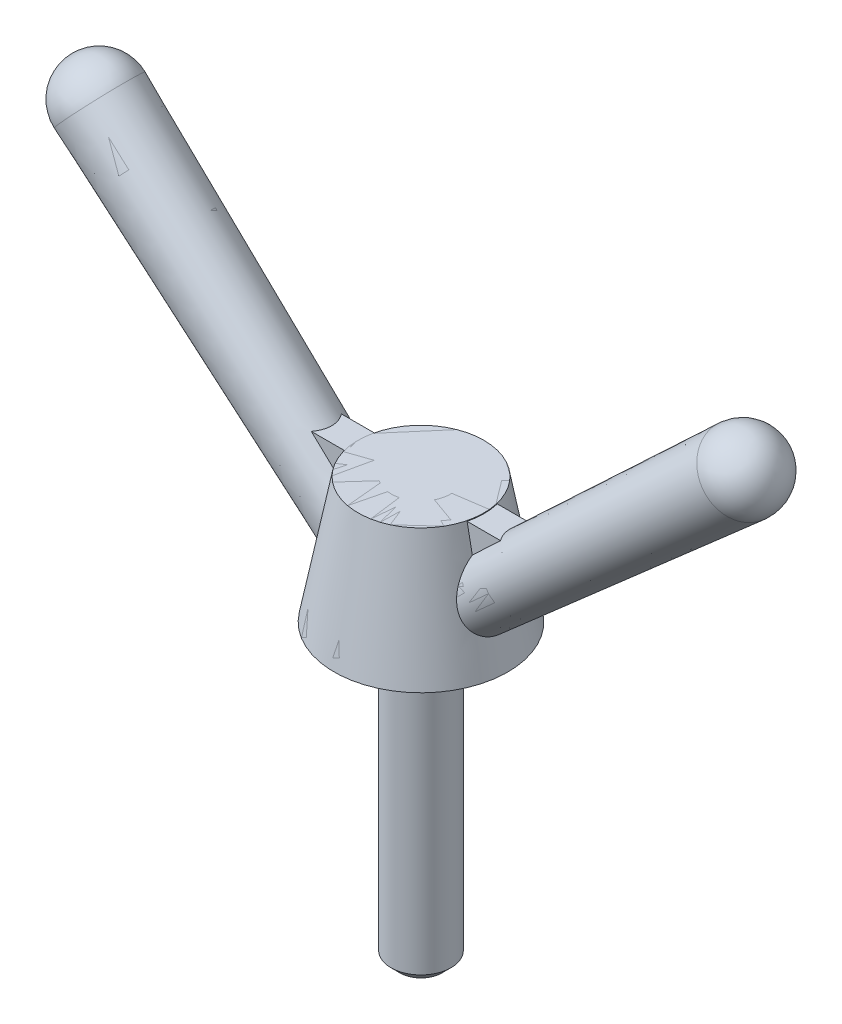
ISO-10303-21;
HEADER;
FILE_DESCRIPTION(('STEP AP214'),'2;1');
FILE_NAME('part.step','',(''),(''),'','','');
FILE_SCHEMA(('AUTOMOTIVE_DESIGN { 1 0 10303 214 1 1 1 1 }'));
ENDSEC;
DATA;
#1=APPLICATION_CONTEXT('core data for automotive mechanical design processes');
#2=APPLICATION_PROTOCOL_DEFINITION('international standard','automotive_design',2000,#1);
#3=PRODUCT_CONTEXT('',#1,'mechanical');
#4=PRODUCT('Part','Part','',(#3));
#5=PRODUCT_RELATED_PRODUCT_CATEGORY('part','',(#4));
#6=PRODUCT_DEFINITION_FORMATION('','',#4);
#7=PRODUCT_DEFINITION_CONTEXT('part definition',#1,'design');
#8=PRODUCT_DEFINITION('design','',#6,#7);
#9=PRODUCT_DEFINITION_SHAPE('','',#8);
#10=(LENGTH_UNIT() NAMED_UNIT(*) SI_UNIT(.MILLI.,.METRE.));
#11=(NAMED_UNIT(*) PLANE_ANGLE_UNIT() SI_UNIT($,.RADIAN.));
#12=(NAMED_UNIT(*) SI_UNIT($,.STERADIAN.) SOLID_ANGLE_UNIT());
#13=UNCERTAINTY_MEASURE_WITH_UNIT(LENGTH_MEASURE(1.E-05),#10,'distance_accuracy_value','');
#14=(GEOMETRIC_REPRESENTATION_CONTEXT(3) GLOBAL_UNCERTAINTY_ASSIGNED_CONTEXT((#13)) GLOBAL_UNIT_ASSIGNED_CONTEXT((#10,
#11,#12)) REPRESENTATION_CONTEXT('',''));
#15=CARTESIAN_POINT('',(0.,0.,0.));
#16=DIRECTION('',(0.,0.,1.));
#17=DIRECTION('',(1.,0.,0.));
#18=AXIS2_PLACEMENT_3D('',#15,#16,#17);
#19=CARTESIAN_POINT('',(14.5,0.,0.));
#20=DIRECTION('',(0.,1.,0.));
#21=DIRECTION('',(0.,0.,1.));
#22=AXIS2_PLACEMENT_3D('',#19,#20,#21);
#23=PLANE('',#22);
#24=CARTESIAN_POINT('',(0.,0.,0.));
#25=DIRECTION('',(0.,-1.,0.));
#26=DIRECTION('',(0.,0.,-1.));
#27=AXIS2_PLACEMENT_3D('',#24,#25,#26);
#28=CIRCLE('',#27,14.5);
#29=CARTESIAN_POINT('',(0.,0.,-14.5));
#30=VERTEX_POINT('',#29);
#31=EDGE_CURVE('P0_E218',#30,#30,#28,.T.);
#32=ORIENTED_EDGE('',*,*,#31,.T.);
#33=EDGE_LOOP('',(#32));
#34=FACE_BOUND('',#33,.T.);
#35=CARTESIAN_POINT('',(0.,0.,0.));
#36=DIRECTION('',(0.,-1.,0.));
#37=DIRECTION('',(1.,0.,0.));
#38=AXIS2_PLACEMENT_3D('',#35,#36,#37);
#39=CIRCLE('',#38,5.);
#40=CARTESIAN_POINT('',(5.,0.,0.));
#41=VERTEX_POINT('',#40);
#42=EDGE_CURVE('P0_E104',#41,#41,#39,.T.);
#43=ORIENTED_EDGE('',*,*,#42,.F.);
#44=EDGE_LOOP('',(#43));
#45=FACE_BOUND('',#44,.T.);
#46=ADVANCED_FACE('P0_F26',(#34,#45),#23,.F.);
#47=CARTESIAN_POINT('',(0.,21.,0.));
#48=DIRECTION('',(0.,-1.,0.));
#49=DIRECTION('',(0.,0.,-1.));
#50=AXIS2_PLACEMENT_3D('',#47,#48,#49);
#51=PLANE('',#50);
#52=CARTESIAN_POINT('',(0.,21.,0.));
#53=DIRECTION('',(0.,-1.,0.));
#54=DIRECTION('',(0.,0.,-1.));
#55=AXIS2_PLACEMENT_3D('',#52,#53,#54);
#56=CIRCLE('',#55,10.5);
#57=CARTESIAN_POINT('',(0.,21.,-10.5));
#58=VERTEX_POINT('',#57);
#59=EDGE_CURVE('P0_E221',#58,#58,#56,.T.);
#60=ORIENTED_EDGE('',*,*,#59,.F.);
#61=EDGE_LOOP('',(#60));
#62=FACE_BOUND('',#61,.T.);
#63=ADVANCED_FACE('P0_F159',(#62),#51,.F.);
#64=CARTESIAN_POINT('',(0.,21.,0.));
#65=DIRECTION('',(0.,-1.,0.));
#66=DIRECTION('',(0.,0.,-1.));
#67=AXIS2_PLACEMENT_3D('',#64,#65,#66);
#68=CONICAL_SURFACE('',#67,10.5,0.188221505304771);
#69=CARTESIAN_POINT('',(0.,20.9,0.));
#70=DIRECTION('',(0.,-1.,0.));
#71=DIRECTION('',(0.,0.,-1.));
#72=AXIS2_PLACEMENT_3D('',#69,#70,#71);
#73=CIRCLE('',#72,10.5190476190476);
#74=CARTESIAN_POINT('',(10.2132813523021,20.9,-2.51778609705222));
#75=VERTEX_POINT('',#74);
#76=CARTESIAN_POINT('',(10.2132813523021,20.9,2.51778609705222));
#77=VERTEX_POINT('',#76);
#78=EDGE_CURVE('P0_E51',#75,#77,#73,.T.);
#79=ORIENTED_EDGE('',*,*,#78,.F.);
#80=CARTESIAN_POINT('',(8.54308379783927,29.3665277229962,-2.51778609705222));
#81=CARTESIAN_POINT('',(8.78661682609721,28.140041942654,-2.51778609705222));
#82=CARTESIAN_POINT('',(9.0293839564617,26.9134044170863,-2.51778609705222));
#83=CARTESIAN_POINT('',(9.51365627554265,24.4598806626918,-2.51778609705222));
#84=CARTESIAN_POINT('',(9.75516146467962,23.232994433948,-2.51778609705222));
#85=CARTESIAN_POINT('',(10.2371796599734,20.7790285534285,-2.51778609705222));
#86=CARTESIAN_POINT('',(10.4776926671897,19.5519489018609,-2.51778609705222));
#87=CARTESIAN_POINT('',(10.9579084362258,17.0976309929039,-2.51778609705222));
#88=CARTESIAN_POINT('',(11.197611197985,15.8703927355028,-2.51778609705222));
#89=CARTESIAN_POINT('',(11.6570489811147,13.5147487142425,-2.51778609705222));
#90=CARTESIAN_POINT('',(11.8768355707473,12.3863530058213,-2.51778609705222));
#91=CARTESIAN_POINT('',(12.3159315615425,10.1294684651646,-2.51778609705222));
#92=CARTESIAN_POINT('',(12.5352409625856,9.00097963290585,-2.51778609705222));
#93=CARTESIAN_POINT('',(13.1022234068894,6.08068209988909,-2.51778609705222));
#94=CARTESIAN_POINT('',(13.4495876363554,4.28881344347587,-2.51778609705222));
#95=CARTESIAN_POINT('',(14.1435076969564,0.704919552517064,-2.51778609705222));
#96=CARTESIAN_POINT('',(14.4900635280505,-1.08710568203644,-2.51778609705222));
#97=CARTESIAN_POINT('',(15.1825250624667,-4.67128015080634,-2.51778609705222));
#98=CARTESIAN_POINT('',(15.5284307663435,-6.46342938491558,-2.51778609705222));
#99=CARTESIAN_POINT('',(16.219705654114,-10.0478311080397,-2.51778609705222));
#100=CARTESIAN_POINT('',(16.565074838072,-11.8400835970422,-2.51778609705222));
#101=CARTESIAN_POINT('',(16.9102324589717,-13.632376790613,-2.51778609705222));
#102=B_SPLINE_CURVE_WITH_KNOTS('',3,(#80,#81,#82,#83,#84,#85,#86,#87,#88,#89,#90,#91,#92,#93,
#94,#95,#96,#97,#98,#99,#100,#101),.UNSPECIFIED.,.F.,.F.,(4,2,2,2,2,2,2,2,2,2,4),(0.,
3.75128991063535,7.50257857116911,11.2538632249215,15.0051481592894,18.4539517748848,
21.9027562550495,27.3784383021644,32.8541206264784,38.329798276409,43.8054752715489),.UNSPECIFIED.);
#103=CARTESIAN_POINT('',(11.0829361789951,16.4570186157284,-2.51778609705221));
#104=VERTEX_POINT('',#103);
#105=EDGE_CURVE('P0_E44',#75,#104,#102,.T.);
#106=ORIENTED_EDGE('',*,*,#105,.T.);
#107=CARTESIAN_POINT('',(12.8609868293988,6.24926257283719,-3.42668656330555));
#108=CARTESIAN_POINT('',(12.9068823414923,6.16489642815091,-3.31685441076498));
#109=CARTESIAN_POINT('',(12.951331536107,6.0850363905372,-3.20300938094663));
#110=CARTESIAN_POINT('',(13.0365861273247,5.9345999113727,-2.96800144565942));
#111=CARTESIAN_POINT('',(13.0773909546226,5.86402491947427,-2.84683740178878));
#112=CARTESIAN_POINT('',(13.154636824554,5.73243690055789,-2.59801740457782));
#113=CARTESIAN_POINT('',(13.1910756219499,5.67142878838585,-2.47035815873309));
#114=CARTESIAN_POINT('',(13.2589436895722,5.55920839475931,-2.20946246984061));
#115=CARTESIAN_POINT('',(13.2903711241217,5.50799970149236,-2.07622400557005));
#116=CARTESIAN_POINT('',(13.3476302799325,5.41561553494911,-1.80529716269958));
#117=CARTESIAN_POINT('',(13.3734674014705,5.37443037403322,-1.66761322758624));
#118=CARTESIAN_POINT('',(13.4191547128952,5.30213499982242,-1.38859853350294));
#119=CARTESIAN_POINT('',(13.4390026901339,5.27102850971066,-1.24726644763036));
#120=CARTESIAN_POINT('',(13.4723573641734,5.21900794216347,-0.96207414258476));
#121=CARTESIAN_POINT('',(13.4858671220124,5.1980889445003,-0.818215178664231));
#122=CARTESIAN_POINT('',(13.5063386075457,5.16646836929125,-0.528863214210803));
#123=CARTESIAN_POINT('',(13.5132979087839,5.15577057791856,-0.383369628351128));
#124=CARTESIAN_POINT('',(13.5205577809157,5.14461184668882,-0.0912901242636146));
#125=CARTESIAN_POINT('',(13.5208338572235,5.14418856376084,0.0552978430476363));
#126=CARTESIAN_POINT('',(13.5146591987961,5.15367741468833,0.3480511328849));
#127=CARTESIAN_POINT('',(13.508205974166,5.16359337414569,0.494216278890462));
#128=CARTESIAN_POINT('',(13.4886799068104,5.19373692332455,0.784983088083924));
#129=CARTESIAN_POINT('',(13.4756093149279,5.21396100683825,0.929585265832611));
#130=CARTESIAN_POINT('',(13.4430629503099,5.26467621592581,1.21630183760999));
#131=CARTESIAN_POINT('',(13.4235848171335,5.29517112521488,1.35841529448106));
#132=CARTESIAN_POINT('',(13.3785382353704,5.3663688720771,1.63918247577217));
#133=CARTESIAN_POINT('',(13.352965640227,5.40707866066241,1.77783377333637));
#134=CARTESIAN_POINT('',(13.2961665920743,5.49859039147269,2.05062884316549));
#135=CARTESIAN_POINT('',(13.2649380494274,5.54939606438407,2.18477092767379));
#136=CARTESIAN_POINT('',(13.1973824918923,5.66091764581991,2.44748696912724));
#137=CARTESIAN_POINT('',(13.1610575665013,5.72162949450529,2.57606317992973));
#138=CARTESIAN_POINT('',(13.0839518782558,5.85273833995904,2.82678022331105));
#139=CARTESIAN_POINT('',(13.0431694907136,5.92313887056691,2.94891868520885));
#140=CARTESIAN_POINT('',(12.9156157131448,6.14778277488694,3.30311879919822));
#141=CARTESIAN_POINT('',(12.8232118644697,6.31614950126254,3.52457809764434));
#142=CARTESIAN_POINT('',(12.6785644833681,6.59408577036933,3.83009740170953));
#143=CARTESIAN_POINT('',(12.6293229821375,6.69100159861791,3.92752242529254));
#144=CARTESIAN_POINT('',(12.529663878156,6.8928460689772,4.11305232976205));
#145=CARTESIAN_POINT('',(12.4792462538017,6.99777485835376,4.20115703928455));
#146=CARTESIAN_POINT('',(12.3281425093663,7.32249188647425,4.44971886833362));
#147=CARTESIAN_POINT('',(12.2269784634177,7.55338720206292,4.59571400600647));
#148=CARTESIAN_POINT('',(12.0302720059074,8.03856351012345,4.84632743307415));
#149=CARTESIAN_POINT('',(11.9347298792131,8.29284568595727,4.95094362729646));
#150=CARTESIAN_POINT('',(11.7519389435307,8.82576538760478,5.12149031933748));
#151=CARTESIAN_POINT('',(11.6650073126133,9.10489278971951,5.18622286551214));
#152=CARTESIAN_POINT('',(11.5062913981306,9.67367091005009,5.27448895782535));
#153=CARTESIAN_POINT('',(11.4345133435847,9.96332589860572,5.29800559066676));
#154=CARTESIAN_POINT('',(11.3003067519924,10.5799921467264,5.30788414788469));
#155=CARTESIAN_POINT('',(11.2398776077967,10.9074968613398,5.28970362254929));
#156=CARTESIAN_POINT('',(11.139084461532,11.5606575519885,5.21162186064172));
#157=CARTESIAN_POINT('',(11.0987336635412,11.886312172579,5.15169323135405));
#158=CARTESIAN_POINT('',(11.0485883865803,12.4009836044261,5.02579651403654));
#159=CARTESIAN_POINT('',(11.0330279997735,12.5925156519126,4.97184809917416));
#160=CARTESIAN_POINT('',(11.007764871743,12.9719070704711,4.85101489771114));
#161=CARTESIAN_POINT('',(10.9980630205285,13.1597658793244,4.78412814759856));
#162=CARTESIAN_POINT('',(10.9838773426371,13.5309259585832,4.63776982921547));
#163=CARTESIAN_POINT('',(10.9793988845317,13.7142223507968,4.55828540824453));
#164=CARTESIAN_POINT('',(10.9749955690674,14.0749979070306,4.3869731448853));
#165=CARTESIAN_POINT('',(10.9750702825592,14.2524776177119,4.29514646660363));
#166=CARTESIAN_POINT('',(10.9789686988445,14.5920703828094,4.10383226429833));
#167=CARTESIAN_POINT('',(10.9826120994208,14.7545120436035,4.0049248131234));
#168=CARTESIAN_POINT('',(10.9927454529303,15.071832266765,3.79569697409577));
#169=CARTESIAN_POINT('',(10.9992357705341,15.2267098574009,3.68537512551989));
#170=CARTESIAN_POINT('',(11.0143756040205,15.5271175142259,3.45318272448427));
#171=CARTESIAN_POINT('',(11.0230218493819,15.6726613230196,3.33132983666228));
#172=CARTESIAN_POINT('',(11.0417402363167,15.9526104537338,3.07563700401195));
#173=CARTESIAN_POINT('',(11.0518117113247,16.0870209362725,2.94180267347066));
#174=CARTESIAN_POINT('',(11.0761010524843,16.385574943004,2.61429479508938));
#175=CARTESIAN_POINT('',(11.0905691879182,16.5443987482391,2.41569232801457));
#176=CARTESIAN_POINT('',(11.1184071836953,16.8298074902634,1.99647217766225));
#177=CARTESIAN_POINT('',(11.1317787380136,16.9564428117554,1.77588966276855));
#178=CARTESIAN_POINT('',(11.1529123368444,17.1489504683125,1.35657555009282));
#179=CARTESIAN_POINT('',(11.1612506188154,17.2216526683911,1.1610406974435));
#180=CARTESIAN_POINT('',(11.1742988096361,17.3335860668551,0.760465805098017));
#181=CARTESIAN_POINT('',(11.1790118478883,17.3728461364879,0.555434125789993));
#182=CARTESIAN_POINT('',(11.1840085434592,17.4144325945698,0.14066776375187));
#183=CARTESIAN_POINT('',(11.1842738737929,17.4166061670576,-0.0690828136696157));
#184=CARTESIAN_POINT('',(11.1802773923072,17.3834001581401,-0.485542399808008));
#185=CARTESIAN_POINT('',(11.1760142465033,17.3480095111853,-0.692250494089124));
#186=CARTESIAN_POINT('',(11.1640766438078,17.2460827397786,-1.08472864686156));
#187=CARTESIAN_POINT('',(11.1566144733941,17.1814729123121,-1.27101767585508));
#188=CARTESIAN_POINT('',(11.1393793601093,17.0263666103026,-1.63223135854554));
#189=CARTESIAN_POINT('',(11.1296054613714,16.9358594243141,-1.80715127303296));
#190=CARTESIAN_POINT('',(11.1032417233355,16.6784139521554,-2.23586812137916));
#191=CARTESIAN_POINT('',(11.085837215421,16.4966858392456,-2.48078703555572));
#192=CARTESIAN_POINT('',(11.0605872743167,16.1969908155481,-2.82405520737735));
#193=CARTESIAN_POINT('',(11.0522991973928,16.092361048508,-2.93463790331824));
#194=CARTESIAN_POINT('',(11.0364321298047,15.8753318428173,-3.1479605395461));
#195=CARTESIAN_POINT('',(11.0288529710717,15.7629342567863,-3.25070233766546));
#196=CARTESIAN_POINT('',(11.0118969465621,15.4836252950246,-3.4894695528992));
#197=CARTESIAN_POINT('',(11.0030747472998,15.313408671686,-3.62166624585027));
#198=CARTESIAN_POINT('',(10.9886784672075,14.9623015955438,-3.87128256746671));
#199=CARTESIAN_POINT('',(10.9831057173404,14.7814068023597,-3.98869612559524));
#200=CARTESIAN_POINT('',(10.9761591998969,14.4107692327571,-4.20916051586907));
#201=CARTESIAN_POINT('',(10.9747895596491,14.2210179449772,-4.31219713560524));
#202=CARTESIAN_POINT('',(10.9771642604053,13.8344456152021,-4.50386172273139));
#203=CARTESIAN_POINT('',(10.980907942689,13.6376254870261,-4.59249154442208));
#204=CARTESIAN_POINT('',(10.9945192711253,13.2339179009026,-4.75694345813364));
#205=CARTESIAN_POINT('',(11.0045178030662,13.0269047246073,-4.83244656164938));
#206=CARTESIAN_POINT('',(11.0316317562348,12.6082187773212,-4.96773494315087));
#207=CARTESIAN_POINT('',(11.048747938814,12.3965455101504,-5.02751853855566));
#208=CARTESIAN_POINT('',(11.0908559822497,11.9703015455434,-5.1304339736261));
#209=CARTESIAN_POINT('',(11.1158351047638,11.7557360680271,-5.17359249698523));
#210=CARTESIAN_POINT('',(11.1743223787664,11.3249580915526,-5.24225198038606));
#211=CARTESIAN_POINT('',(11.2078280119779,11.1087460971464,-5.26775814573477));
#212=CARTESIAN_POINT('',(11.2753079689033,10.7245906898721,-5.29620246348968));
#213=CARTESIAN_POINT('',(11.3075195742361,10.5566104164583,-5.30289906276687));
#214=CARTESIAN_POINT('',(11.3773666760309,10.2217429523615,-5.30410987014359));
#215=CARTESIAN_POINT('',(11.4150011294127,10.0548555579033,-5.29862641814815));
#216=CARTESIAN_POINT('',(11.4955532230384,9.72331025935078,-5.27479207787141));
#217=CARTESIAN_POINT('',(11.5384697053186,9.55865187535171,-5.2564440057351));
#218=CARTESIAN_POINT('',(11.6292446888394,9.23276866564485,-5.20625512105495));
#219=CARTESIAN_POINT('',(11.6771032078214,9.07154385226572,-5.17441426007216));
#220=CARTESIAN_POINT('',(11.7775601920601,8.75264894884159,-5.09644114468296));
#221=CARTESIAN_POINT('',(11.8301921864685,8.59501559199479,-5.05020118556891));
#222=CARTESIAN_POINT('',(11.9390186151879,8.2860362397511,-4.94320826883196));
#223=CARTESIAN_POINT('',(11.9952126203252,8.13468949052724,-4.88245705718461));
#224=CARTESIAN_POINT('',(12.1100204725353,7.83982141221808,-4.74644938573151));
#225=CARTESIAN_POINT('',(12.1686317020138,7.69629198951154,-4.67120830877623));
#226=CARTESIAN_POINT('',(12.2870222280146,7.41827274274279,-4.50645345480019));
#227=CARTESIAN_POINT('',(12.3468011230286,7.28377987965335,-4.41694451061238));
#228=CARTESIAN_POINT('',(12.4847862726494,6.98454898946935,-4.19401939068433));
#229=CARTESIAN_POINT('',(12.5629250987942,6.82345985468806,-4.05561582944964));
#230=CARTESIAN_POINT('',(12.7155250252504,6.52107500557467,-3.75690305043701));
#231=CARTESIAN_POINT('',(12.789986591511,6.37977677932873,-3.59659661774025));
#232=CARTESIAN_POINT('',(12.8609868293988,6.24926257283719,-3.42668656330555));
#233=B_SPLINE_CURVE_WITH_KNOTS('',3,(#107,#108,#109,#110,#111,#112,#113,#114,#115,#116,#117,
#118,#119,#120,#121,#122,#123,#124,#125,#126,#127,#128,#129,#130,#131,#132,#133,#134,#135,#136,
#137,#138,#139,#140,#141,#142,#143,#144,#145,#146,#147,#148,#149,#150,#151,#152,#153,#154,#155,
#156,#157,#158,#159,#160,#161,#162,#163,#164,#165,#166,#167,#168,#169,#170,#171,#172,#173,#174,
#175,#176,#177,#178,#179,#180,#181,#182,#183,#184,#185,#186,#187,#188,#189,#190,#191,#192,#193,
#194,#195,#196,#197,#198,#199,#200,#201,#202,#203,#204,#205,#206,#207,#208,#209,#210,#211,#212,
#213,#214,#215,#216,#217,#218,#219,#220,#221,#222,#223,#224,#225,#226,#227,#228,#229,#230,#231,
#232),.UNSPECIFIED.,.T.,.F.,(4,2,2,2,2,2,2,2,2,2,2,2,2,2,2,2,2,2,2,2,2,2,2,2,2,2,2,2,2,2,2,2,2,
2,2,2,2,2,2,2,2,2,2,2,2,2,2,2,2,2,2,2,2,2,2,2,2,2,2,2,2,2,4),(0.,0.437504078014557,
0.875076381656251,1.31287275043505,1.75082911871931,2.18836051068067,2.62605334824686,
3.06353458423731,3.50117781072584,3.9404247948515,4.37983436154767,4.81909456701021,
5.25851677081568,5.69823880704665,6.13812363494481,6.57782863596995,7.01769444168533,
7.892086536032,8.32959698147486,8.76711546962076,9.63665819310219,10.5062449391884,
11.4008180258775,12.2957581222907,13.2927464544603,14.2903895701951,14.8886926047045,
15.4870865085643,16.0860948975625,16.6850468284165,17.2552205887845,17.8254674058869,
18.3948543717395,18.9639759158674,19.7255898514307,20.4860041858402,21.1097682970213,
21.7329933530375,22.3587858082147,22.9847626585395,23.5744185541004,24.1643186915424,
25.0752410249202,25.5323615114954,25.9893733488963,26.6355758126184,27.2820427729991,
27.9291443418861,28.5761625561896,29.2371948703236,29.8982979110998,30.5583353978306,
31.2181781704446,31.7312189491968,32.2441611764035,32.7569911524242,33.2698229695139,
33.786586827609,34.3032885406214,34.8194447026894,35.3354264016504,36.0123300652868,
36.6891477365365),.UNSPECIFIED.);
#234=CARTESIAN_POINT('',(11.0829361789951,16.4570186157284,2.51778609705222));
#235=VERTEX_POINT('',#234);
#236=EDGE_CURVE('P0_E150',#104,#235,#233,.T.);
#237=ORIENTED_EDGE('',*,*,#236,.T.);
#238=CARTESIAN_POINT('',(8.54308379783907,29.3665277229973,2.51778609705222));
#239=CARTESIAN_POINT('',(8.786616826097,28.140041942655,2.51778609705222));
#240=CARTESIAN_POINT('',(9.02938395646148,26.9134044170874,2.51778609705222));
#241=CARTESIAN_POINT('',(9.51365627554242,24.459880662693,2.51778609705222));
#242=CARTESIAN_POINT('',(9.75516146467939,23.2329944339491,2.51778609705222));
#243=CARTESIAN_POINT('',(10.2371796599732,20.7790285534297,2.51778609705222));
#244=CARTESIAN_POINT('',(10.4776926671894,19.5519489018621,2.51778609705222));
#245=CARTESIAN_POINT('',(10.9579084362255,17.0976309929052,2.51778609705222));
#246=CARTESIAN_POINT('',(11.1976111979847,15.8703927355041,2.51778609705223));
#247=CARTESIAN_POINT('',(11.6570489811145,13.5147487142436,2.51778609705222));
#248=CARTESIAN_POINT('',(11.8768355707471,12.3863530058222,2.51778609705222));
#249=CARTESIAN_POINT('',(12.3159315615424,10.1294684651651,2.51778609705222));
#250=CARTESIAN_POINT('',(12.5352409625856,9.00097963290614,2.51778609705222));
#251=CARTESIAN_POINT('',(13.1022234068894,6.08068209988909,2.51778609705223));
#252=CARTESIAN_POINT('',(13.4495876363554,4.28881344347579,2.51778609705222));
#253=CARTESIAN_POINT('',(14.1435076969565,0.70491955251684,2.51778609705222));
#254=CARTESIAN_POINT('',(14.4900635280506,-1.08710568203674,2.51778609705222));
#255=CARTESIAN_POINT('',(15.1825250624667,-4.6712801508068,2.51778609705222));
#256=CARTESIAN_POINT('',(15.5284307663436,-6.46342938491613,2.51778609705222));
#257=CARTESIAN_POINT('',(16.2197056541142,-10.0478311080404,2.51778609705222));
#258=CARTESIAN_POINT('',(16.5650748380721,-11.840083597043,2.51778609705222));
#259=CARTESIAN_POINT('',(16.9102324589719,-13.6323767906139,2.51778609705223));
#260=B_SPLINE_CURVE_WITH_KNOTS('',3,(#238,#239,#240,#241,#242,#243,#244,#245,#246,#247,#248,
#249,#250,#251,#252,#253,#254,#255,#256,#257,#258,#259),.UNSPECIFIED.,.F.,.F.,(4,2,2,2,2,2,2,2,
2,2,4),(0.,3.75128991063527,7.50257857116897,11.2538632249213,15.0051481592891,18.4539517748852,
21.9027562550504,27.3784383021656,32.8541206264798,38.3297982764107,43.8054752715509),.UNSPECIFIED.);
#261=EDGE_CURVE('P0_E109',#77,#235,#260,.T.);
#262=ORIENTED_EDGE('',*,*,#261,.F.);
#263=EDGE_LOOP('',(#79,#106,#237,#262));
#264=FACE_BOUND('',#263,.T.);
#265=CARTESIAN_POINT('',(0.,20.9,0.));
#266=DIRECTION('',(0.,-1.,0.));
#267=DIRECTION('',(0.,0.,-1.));
#268=AXIS2_PLACEMENT_3D('',#265,#266,#267);
#269=CIRCLE('',#268,10.5190476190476);
#270=CARTESIAN_POINT('',(-10.2132813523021,20.9,2.51778609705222));
#271=VERTEX_POINT('',#270);
#272=CARTESIAN_POINT('',(-10.2132813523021,20.9,-2.51778609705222));
#273=VERTEX_POINT('',#272);
#274=EDGE_CURVE('P0_E227',#271,#273,#269,.T.);
#275=ORIENTED_EDGE('',*,*,#274,.F.);
#276=CARTESIAN_POINT('',(-8.54308379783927,29.3665277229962,2.51778609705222));
#277=CARTESIAN_POINT('',(-8.78661682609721,28.140041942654,2.51778609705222));
#278=CARTESIAN_POINT('',(-9.0293839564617,26.9134044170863,2.51778609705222));
#279=CARTESIAN_POINT('',(-9.51365627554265,24.4598806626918,2.51778609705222));
#280=CARTESIAN_POINT('',(-9.75516146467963,23.232994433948,2.51778609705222));
#281=CARTESIAN_POINT('',(-10.2371796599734,20.7790285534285,2.51778609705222));
#282=CARTESIAN_POINT('',(-10.4776926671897,19.5519489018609,2.51778609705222));
#283=CARTESIAN_POINT('',(-10.9579084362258,17.0976309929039,2.51778609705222));
#284=CARTESIAN_POINT('',(-11.197611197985,15.8703927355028,2.51778609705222));
#285=CARTESIAN_POINT('',(-11.6570489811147,13.5147487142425,2.51778609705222));
#286=CARTESIAN_POINT('',(-11.8768355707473,12.3863530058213,2.51778609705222));
#287=CARTESIAN_POINT('',(-12.3159315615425,10.1294684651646,2.51778609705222));
#288=CARTESIAN_POINT('',(-12.5352409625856,9.00097963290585,2.51778609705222));
#289=CARTESIAN_POINT('',(-13.1022234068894,6.08068209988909,2.51778609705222));
#290=CARTESIAN_POINT('',(-13.4495876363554,4.28881344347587,2.51778609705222));
#291=CARTESIAN_POINT('',(-14.1435076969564,0.704919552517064,2.51778609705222));
#292=CARTESIAN_POINT('',(-14.4900635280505,-1.08710568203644,2.51778609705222));
#293=CARTESIAN_POINT('',(-15.1825250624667,-4.67128015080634,2.51778609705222));
#294=CARTESIAN_POINT('',(-15.5284307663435,-6.46342938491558,2.51778609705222));
#295=CARTESIAN_POINT('',(-16.219705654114,-10.0478311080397,2.51778609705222));
#296=CARTESIAN_POINT('',(-16.565074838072,-11.8400835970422,2.51778609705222));
#297=CARTESIAN_POINT('',(-16.9102324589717,-13.632376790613,2.51778609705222));
#298=B_SPLINE_CURVE_WITH_KNOTS('',3,(#276,#277,#278,#279,#280,#281,#282,#283,#284,#285,#286,
#287,#288,#289,#290,#291,#292,#293,#294,#295,#296,#297),.UNSPECIFIED.,.F.,.F.,(4,2,2,2,2,2,2,2,
2,2,4),(0.,3.75128991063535,7.50257857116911,11.2538632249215,15.0051481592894,18.4539517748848,
21.9027562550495,27.3784383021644,32.8541206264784,38.329798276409,43.8054752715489),.UNSPECIFIED.);
#299=CARTESIAN_POINT('',(-11.0829361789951,16.4570186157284,2.51778609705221));
#300=VERTEX_POINT('',#299);
#301=EDGE_CURVE('P0_E180',#271,#300,#298,.T.);
#302=ORIENTED_EDGE('',*,*,#301,.T.);
#303=CARTESIAN_POINT('',(-12.8609868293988,6.24926257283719,-3.42668656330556));
#304=CARTESIAN_POINT('',(-12.8147038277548,6.3343407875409,-3.53745296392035));
#305=CARTESIAN_POINT('',(-12.7669668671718,6.42397051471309,-3.64410420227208));
#306=CARTESIAN_POINT('',(-12.6694373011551,6.61192434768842,-3.84850339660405));
#307=CARTESIAN_POINT('',(-12.619644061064,6.71025114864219,-3.94624857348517));
#308=CARTESIAN_POINT('',(-12.518872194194,6.9151371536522,-4.13227516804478));
#309=CARTESIAN_POINT('',(-12.4678923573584,7.02170504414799,-4.22054635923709));
#310=CARTESIAN_POINT('',(-12.3657135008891,7.2423419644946,-4.3870166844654));
#311=CARTESIAN_POINT('',(-12.3145144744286,7.3564112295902,-4.46521550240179));
#312=CARTESIAN_POINT('',(-12.2128948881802,7.59106700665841,-4.61103612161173));
#313=CARTESIAN_POINT('',(-12.1624729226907,7.71163937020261,-4.67867972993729));
#314=CARTESIAN_POINT('',(-12.0631201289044,7.95871558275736,-4.80339476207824));
#315=CARTESIAN_POINT('',(-12.0141893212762,8.08521951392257,-4.86046603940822));
#316=CARTESIAN_POINT('',(-11.9185696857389,8.34324968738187,-4.96397650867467));
#317=CARTESIAN_POINT('',(-11.8718799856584,8.47477393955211,-5.01041986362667));
#318=CARTESIAN_POINT('',(-11.7813211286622,8.74205495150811,-5.09282457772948));
#319=CARTESIAN_POINT('',(-11.7374529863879,8.87781320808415,-5.12878218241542));
#320=CARTESIAN_POINT('',(-11.6514953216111,9.15768164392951,-5.19155368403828));
#321=CARTESIAN_POINT('',(-11.6095295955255,9.30191566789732,-5.21798490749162));
#322=CARTESIAN_POINT('',(-11.529544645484,9.59303286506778,-5.26018874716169));
#323=CARTESIAN_POINT('',(-11.4915268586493,9.73991698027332,-5.27595749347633));
#324=CARTESIAN_POINT('',(-11.3838062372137,10.1831826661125,-5.30790806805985));
#325=CARTESIAN_POINT('',(-11.3203942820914,10.4823137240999,-5.30876361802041));
#326=CARTESIAN_POINT('',(-11.2030989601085,11.1240179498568,-5.27098121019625));
#327=CARTESIAN_POINT('',(-11.1518619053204,11.466706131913,-5.22669686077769));
#328=CARTESIAN_POINT('',(-11.0701794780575,12.1465026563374,-5.095169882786));
#329=CARTESIAN_POINT('',(-11.0397551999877,12.4836050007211,-5.00788382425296));
#330=CARTESIAN_POINT('',(-11.0052653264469,13.0148674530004,-4.83640604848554));
#331=CARTESIAN_POINT('',(-10.9955335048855,13.2128131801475,-4.76465363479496));
#332=CARTESIAN_POINT('',(-10.9818033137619,13.6033689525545,-4.6072071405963));
#333=CARTESIAN_POINT('',(-10.9778061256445,13.7959778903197,-4.5215101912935));
#334=CARTESIAN_POINT('',(-10.9747509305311,14.1745702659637,-4.33636288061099));
#335=CARTESIAN_POINT('',(-10.9756943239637,14.3605518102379,-4.2369086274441));
#336=CARTESIAN_POINT('',(-10.9816826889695,14.7243531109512,-4.02420778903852));
#337=CARTESIAN_POINT('',(-10.9867265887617,14.9021749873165,-3.91096481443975));
#338=CARTESIAN_POINT('',(-10.9986001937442,15.2106683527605,-3.69626741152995));
#339=CARTESIAN_POINT('',(-11.0048115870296,15.3432483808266,-3.59752439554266));
#340=CARTESIAN_POINT('',(-11.0187546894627,15.6011692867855,-3.3911583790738));
#341=CARTESIAN_POINT('',(-11.0264864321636,15.726510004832,-3.2835351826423));
#342=CARTESIAN_POINT('',(-11.0512265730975,16.0894176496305,-2.9472144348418));
#343=CARTESIAN_POINT('',(-11.0698111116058,16.3145701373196,-2.70459014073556));
#344=CARTESIAN_POINT('',(-11.1015468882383,16.6605064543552,-2.25429868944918));
#345=CARTESIAN_POINT('',(-11.1147767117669,16.7929227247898,-2.05557424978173));
#346=CARTESIAN_POINT('',(-11.1390810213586,17.024740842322,-1.63949758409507));
#347=CARTESIAN_POINT('',(-11.1501586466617,17.1241909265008,-1.42217316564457));
#348=CARTESIAN_POINT('',(-11.1667678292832,17.2695754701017,-1.00783373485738));
#349=CARTESIAN_POINT('',(-11.1728950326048,17.321438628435,-0.812940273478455));
#350=CARTESIAN_POINT('',(-11.1812588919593,17.3917124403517,-0.417123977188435));
#351=CARTESIAN_POINT('',(-11.1834982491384,17.4101463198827,-0.216205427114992));
#352=CARTESIAN_POINT('',(-11.1837101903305,17.4119026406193,0.186047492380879));
#353=CARTESIAN_POINT('',(-11.1816773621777,17.395180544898,0.3873820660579));
#354=CARTESIAN_POINT('',(-11.1736826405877,17.3280956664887,0.784276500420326));
#355=CARTESIAN_POINT('',(-11.167718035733,17.2777096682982,0.97983227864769));
#356=CARTESIAN_POINT('',(-11.1511481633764,17.133046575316,1.40208986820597));
#357=CARTESIAN_POINT('',(-11.1398147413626,17.0315962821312,1.62628919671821));
#358=CARTESIAN_POINT('',(-11.1148440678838,16.793703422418,2.0550530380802));
#359=CARTESIAN_POINT('',(-11.101202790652,16.657199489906,2.25958224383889));
#360=CARTESIAN_POINT('',(-11.0680971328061,16.2952334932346,2.72830843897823));
#361=CARTESIAN_POINT('',(-11.0485610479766,16.0563433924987,2.98213235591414));
#362=CARTESIAN_POINT('',(-11.0229596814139,15.6707973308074,3.33236182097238));
#363=CARTESIAN_POINT('',(-11.01503468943,15.5375449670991,3.44415308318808));
#364=CARTESIAN_POINT('',(-11.0009651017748,15.2632552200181,3.65794607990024));
#365=CARTESIAN_POINT('',(-10.9948204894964,15.1222179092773,3.75994790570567));
#366=CARTESIAN_POINT('',(-10.9832532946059,14.7876300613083,3.98535190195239));
#367=CARTESIAN_POINT('',(-10.9786847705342,14.5916673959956,4.10521556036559));
#368=CARTESIAN_POINT('',(-10.9746929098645,14.1905704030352,4.32864258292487));
#369=CARTESIAN_POINT('',(-10.9752711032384,13.985433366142,4.43220109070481));
#370=CARTESIAN_POINT('',(-10.9826491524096,13.5676047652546,4.62306525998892));
#371=CARTESIAN_POINT('',(-10.9894549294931,13.3549061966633,4.71035535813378));
#372=CARTESIAN_POINT('',(-11.0103194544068,12.9237381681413,4.86816569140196));
#373=CARTESIAN_POINT('',(-11.0243773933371,12.7052693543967,4.93868779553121));
#374=CARTESIAN_POINT('',(-11.060792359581,12.2629259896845,5.06252436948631));
#375=CARTESIAN_POINT('',(-11.0831921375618,12.0390292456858,5.11574750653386));
#376=CARTESIAN_POINT('',(-11.1371214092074,11.588586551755,5.20332474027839));
#377=CARTESIAN_POINT('',(-11.1686520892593,11.3620402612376,5.23767638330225));
#378=CARTESIAN_POINT('',(-11.241338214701,10.9089011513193,5.28595109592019));
#379=CARTESIAN_POINT('',(-11.2824677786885,10.6823100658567,5.29992837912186));
#380=CARTESIAN_POINT('',(-11.3745995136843,10.2308764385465,5.3059365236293));
#381=CARTESIAN_POINT('',(-11.4255963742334,10.006033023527,5.29797915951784));
#382=CARTESIAN_POINT('',(-11.5195958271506,9.63066770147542,5.26467172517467));
#383=CARTESIAN_POINT('',(-11.5600928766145,9.47894317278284,5.2455560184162));
#384=CARTESIAN_POINT('',(-11.6452423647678,9.17860761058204,5.19573383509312));
#385=CARTESIAN_POINT('',(-11.6898937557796,9.02999580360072,5.16503027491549));
#386=CARTESIAN_POINT('',(-11.782858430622,8.73698427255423,5.09166494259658));
#387=CARTESIAN_POINT('',(-11.8311702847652,8.59258293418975,5.04900782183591));
#388=CARTESIAN_POINT('',(-11.9308119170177,8.30901638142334,4.95149217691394));
#389=CARTESIAN_POINT('',(-11.9821418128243,8.16985137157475,4.89663317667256));
#390=CARTESIAN_POINT('',(-12.0872148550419,7.89726359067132,4.77439417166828));
#391=CARTESIAN_POINT('',(-12.1409674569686,7.76386818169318,4.70696117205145));
#392=CARTESIAN_POINT('',(-12.249696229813,7.50450945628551,4.55987731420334));
#393=CARTESIAN_POINT('',(-12.30467240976,7.37854619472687,4.48022636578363));
#394=CARTESIAN_POINT('',(-12.4147654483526,7.1350071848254,4.30906075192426));
#395=CARTESIAN_POINT('',(-12.4698823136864,7.01743184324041,4.21754551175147));
#396=CARTESIAN_POINT('',(-12.5791132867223,6.79152260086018,4.02321346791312));
#397=CARTESIAN_POINT('',(-12.6332274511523,6.68318817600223,3.92039730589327));
#398=CARTESIAN_POINT('',(-12.7354382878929,6.48401479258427,3.71209175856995));
#399=CARTESIAN_POINT('',(-12.7836860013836,6.39247610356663,3.60734412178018));
#400=CARTESIAN_POINT('',(-12.8774731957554,6.21838444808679,3.38943080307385));
#401=CARTESIAN_POINT('',(-12.9230117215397,6.13583464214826,3.27626218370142));
#402=CARTESIAN_POINT('',(-13.0105089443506,5.9801790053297,3.04239269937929));
#403=CARTESIAN_POINT('',(-13.0524693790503,5.90706858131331,2.92169554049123));
#404=CARTESIAN_POINT('',(-13.132094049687,5.77051845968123,2.67353686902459));
#405=CARTESIAN_POINT('',(-13.1697566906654,5.7070823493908,2.54607287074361));
#406=CARTESIAN_POINT('',(-13.2396369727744,5.59091210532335,2.28705139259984));
#407=CARTESIAN_POINT('',(-13.2719193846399,5.53804885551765,2.15556925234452));
#408=CARTESIAN_POINT('',(-13.3310879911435,5.44215395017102,1.88783722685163));
#409=CARTESIAN_POINT('',(-13.357972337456,5.39912566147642,1.75158572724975));
#410=CARTESIAN_POINT('',(-13.4058724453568,5.32305794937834,1.47534568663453));
#411=CARTESIAN_POINT('',(-13.4268893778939,5.29001653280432,1.33535789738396));
#412=CARTESIAN_POINT('',(-13.4627116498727,5.23400030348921,1.05260089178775));
#413=CARTESIAN_POINT('',(-13.4775169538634,5.21102554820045,0.90983165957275));
#414=CARTESIAN_POINT('',(-13.5007535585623,5.17507409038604,0.621487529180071));
#415=CARTESIAN_POINT('',(-13.5091387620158,5.16216968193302,0.475899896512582));
#416=CARTESIAN_POINT('',(-13.5192190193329,5.14666595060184,0.183996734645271));
#417=CARTESIAN_POINT('',(-13.5209163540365,5.14406311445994,0.0376814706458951));
#418=CARTESIAN_POINT('',(-13.5175979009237,5.14916089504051,-0.254791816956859));
#419=CARTESIAN_POINT('',(-13.5125776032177,5.1568684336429,-0.400949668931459));
#420=CARTESIAN_POINT('',(-13.4959025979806,5.18257533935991,-0.691921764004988));
#421=CARTESIAN_POINT('',(-13.484250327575,5.20057092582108,-0.836736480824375));
#422=CARTESIAN_POINT('',(-13.4544511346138,5.24689346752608,-1.12459730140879));
#423=CARTESIAN_POINT('',(-13.4362797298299,5.27525937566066,-1.26763460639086));
#424=CARTESIAN_POINT('',(-13.3937657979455,5.342223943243,-1.55030043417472));
#425=CARTESIAN_POINT('',(-13.3694255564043,5.38081881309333,-1.68993019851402));
#426=CARTESIAN_POINT('',(-13.3150162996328,5.46808862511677,-1.96468571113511));
#427=CARTESIAN_POINT('',(-13.284953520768,5.51675259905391,-2.09981617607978));
#428=CARTESIAN_POINT('',(-13.2196146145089,5.62401358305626,-2.36471363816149));
#429=CARTESIAN_POINT('',(-13.184340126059,5.68260747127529,-2.49448230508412));
#430=CARTESIAN_POINT('',(-13.1043131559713,5.81777085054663,-2.76419624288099));
#431=CARTESIAN_POINT('',(-13.0589248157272,5.89568571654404,-2.90328171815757));
#432=CARTESIAN_POINT('',(-12.9633002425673,6.06356696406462,-3.17221042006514));
#433=CARTESIAN_POINT('',(-12.9130639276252,6.15353354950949,-3.30205349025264));
#434=CARTESIAN_POINT('',(-12.8609868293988,6.24926257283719,-3.42668656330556));
#435=B_SPLINE_CURVE_WITH_KNOTS('',3,(#303,#304,#305,#306,#307,#308,#309,#310,#311,#312,#313,
#314,#315,#316,#317,#318,#319,#320,#321,#322,#323,#324,#325,#326,#327,#328,#329,#330,#331,#332,
#333,#334,#335,#336,#337,#338,#339,#340,#341,#342,#343,#344,#345,#346,#347,#348,#349,#350,#351,
#352,#353,#354,#355,#356,#357,#358,#359,#360,#361,#362,#363,#364,#365,#366,#367,#368,#369,#370,
#371,#372,#373,#374,#375,#376,#377,#378,#379,#380,#381,#382,#383,#384,#385,#386,#387,#388,#389,
#390,#391,#392,#393,#394,#395,#396,#397,#398,#399,#400,#401,#402,#403,#404,#405,#406,#407,#408,
#409,#410,#411,#412,#413,#414,#415,#416,#417,#418,#419,#420,#421,#422,#423,#424,#425,#426,#427,
#428,#429,#430,#431,#432,#433,#434),.UNSPECIFIED.,.T.,.F.,(4,2,2,2,2,2,2,2,2,2,2,2,2,2,2,2,2,2,
2,2,2,2,2,2,2,2,2,2,2,2,2,2,2,2,2,2,2,2,2,2,2,2,2,2,2,2,2,2,2,2,2,2,2,2,2,2,2,2,2,2,2,2,2,2,2,
4),(0.,0.441264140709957,0.882665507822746,1.32453864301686,1.76642564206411,2.20738725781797,
2.64835498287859,3.08914968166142,3.53010201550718,3.98718745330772,4.44443869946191,
5.35850927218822,6.40286236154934,7.44827237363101,8.08006727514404,8.71199231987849,
9.34409649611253,9.97603550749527,10.4719144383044,10.9678043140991,11.9570651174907,
12.6722059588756,13.3862957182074,13.9889722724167,14.5912299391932,15.1942510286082,
15.7976884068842,16.5326609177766,17.2689289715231,18.3101465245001,18.8321916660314,
19.3542319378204,20.0426285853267,20.7312298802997,21.4204865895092,22.1096664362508,
22.802427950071,23.4952795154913,24.1862841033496,24.8769178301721,25.3510476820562,
25.8250582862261,26.2988846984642,26.7727296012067,27.2486186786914,27.7245112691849,
28.2004269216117,28.6763155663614,29.1174994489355,29.5588379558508,29.99996089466,
30.4412470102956,30.8767617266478,31.3124253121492,31.7480018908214,32.1835809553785,
32.6222589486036,33.0607873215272,33.4996102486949,33.9382720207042,34.3785987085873,
34.8187624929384,35.2584493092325,35.6979981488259,36.1944950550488,36.6910003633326),.UNSPECIFIED.);
#436=CARTESIAN_POINT('',(-11.0829361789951,16.4570186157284,-2.51778609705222));
#437=VERTEX_POINT('',#436);
#438=EDGE_CURVE('P0_E174',#300,#437,#435,.T.);
#439=ORIENTED_EDGE('',*,*,#438,.T.);
#440=CARTESIAN_POINT('',(-8.54308379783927,29.3665277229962,-2.51778609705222));
#441=CARTESIAN_POINT('',(-8.78661682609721,28.140041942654,-2.51778609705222));
#442=CARTESIAN_POINT('',(-9.0293839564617,26.9134044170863,-2.51778609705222));
#443=CARTESIAN_POINT('',(-9.51365627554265,24.4598806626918,-2.51778609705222));
#444=CARTESIAN_POINT('',(-9.75516146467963,23.232994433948,-2.51778609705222));
#445=CARTESIAN_POINT('',(-10.2371796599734,20.7790285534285,-2.51778609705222));
#446=CARTESIAN_POINT('',(-10.4776926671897,19.5519489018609,-2.51778609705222));
#447=CARTESIAN_POINT('',(-10.9579084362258,17.0976309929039,-2.51778609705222));
#448=CARTESIAN_POINT('',(-11.197611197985,15.8703927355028,-2.51778609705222));
#449=CARTESIAN_POINT('',(-11.6570489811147,13.5147487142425,-2.51778609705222));
#450=CARTESIAN_POINT('',(-11.8768355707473,12.3863530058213,-2.51778609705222));
#451=CARTESIAN_POINT('',(-12.3159315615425,10.1294684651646,-2.51778609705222));
#452=CARTESIAN_POINT('',(-12.5352409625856,9.00097963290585,-2.51778609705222));
#453=CARTESIAN_POINT('',(-13.1022234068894,6.08068209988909,-2.51778609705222));
#454=CARTESIAN_POINT('',(-13.4495876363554,4.28881344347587,-2.51778609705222));
#455=CARTESIAN_POINT('',(-14.1435076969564,0.704919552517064,-2.51778609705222));
#456=CARTESIAN_POINT('',(-14.4900635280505,-1.08710568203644,-2.51778609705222));
#457=CARTESIAN_POINT('',(-15.1825250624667,-4.67128015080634,-2.51778609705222));
#458=CARTESIAN_POINT('',(-15.5284307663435,-6.46342938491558,-2.51778609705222));
#459=CARTESIAN_POINT('',(-16.219705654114,-10.0478311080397,-2.51778609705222));
#460=CARTESIAN_POINT('',(-16.565074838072,-11.8400835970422,-2.51778609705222));
#461=CARTESIAN_POINT('',(-16.9102324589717,-13.632376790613,-2.51778609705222));
#462=B_SPLINE_CURVE_WITH_KNOTS('',3,(#440,#441,#442,#443,#444,#445,#446,#447,#448,#449,#450,
#451,#452,#453,#454,#455,#456,#457,#458,#459,#460,#461),.UNSPECIFIED.,.F.,.F.,(4,2,2,2,2,2,2,2,
2,2,4),(0.,3.75128991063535,7.50257857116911,11.2538632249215,15.0051481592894,18.4539517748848,
21.9027562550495,27.3784383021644,32.8541206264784,38.329798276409,43.8054752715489),.UNSPECIFIED.);
#463=EDGE_CURVE('P0_E164',#273,#437,#462,.T.);
#464=ORIENTED_EDGE('',*,*,#463,.F.);
#465=EDGE_LOOP('',(#275,#302,#439,#464));
#466=FACE_BOUND('',#465,.T.);
#467=ORIENTED_EDGE('',*,*,#31,.F.);
#468=EDGE_LOOP('',(#467));
#469=FACE_BOUND('',#468,.T.);
#470=ORIENTED_EDGE('',*,*,#59,.T.);
#471=EDGE_LOOP('',(#470));
#472=FACE_BOUND('',#471,.T.);
#473=ADVANCED_FACE('P0_F154',(#264,#466,#469,#472),#68,.T.);
#474=CARTESIAN_POINT('',(-53.6185543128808,48.6261377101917,0.));
#475=DIRECTION('',(-0.740750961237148,0.671779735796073,0.));
#476=DIRECTION('',(0.,0.,1.));
#477=AXIS2_PLACEMENT_3D('',#474,#475,#476);
#478=CONICAL_SURFACE('',#477,6.29904047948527,0.0174532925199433);
#479=CARTESIAN_POINT('',(-53.6185543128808,48.6261377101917,0.));
#480=DIRECTION('',(-0.740750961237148,0.671779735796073,0.));
#481=DIRECTION('',(0.,0.,1.));
#482=AXIS2_PLACEMENT_3D('',#479,#480,#481);
#483=CIRCLE('',#482,6.29904047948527);
#484=CARTESIAN_POINT('',(-53.6185543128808,48.6261377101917,6.29904047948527));
#485=VERTEX_POINT('',#484);
#486=EDGE_CURVE('P0_E268',#485,#485,#483,.T.);
#487=ORIENTED_EDGE('',*,*,#486,.F.);
#488=EDGE_LOOP('',(#487));
#489=FACE_BOUND('',#488,.T.);
#490=ORIENTED_EDGE('',*,*,#438,.F.);
#491=CARTESIAN_POINT('',(-53.5171019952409,56.4620866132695,2.51778609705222));
#492=CARTESIAN_POINT('',(-50.4697855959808,53.5911800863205,2.51778609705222));
#493=CARTESIAN_POINT('',(-47.4226364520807,50.7200960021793,2.51778609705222));
#494=CARTESIAN_POINT('',(-39.397046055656,43.1571977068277,2.51778609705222));
#495=CARTESIAN_POINT('',(-34.4189302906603,38.4650380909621,2.51778609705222));
#496=CARTESIAN_POINT('',(-24.4639809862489,29.0793588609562,2.51778609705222));
#497=CARTESIAN_POINT('',(-19.48714744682,24.3858392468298,2.51778609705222));
#498=CARTESIAN_POINT('',(-11.9116562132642,17.2390990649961,2.51778609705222));
#499=CARTESIAN_POINT('',(-9.31240350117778,14.786509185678,2.51778609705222));
#500=CARTESIAN_POINT('',(-1.5154076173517,7.42793051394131,2.51778609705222));
#501=CARTESIAN_POINT('',(3.6815726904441,2.5211332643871,2.51778609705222));
#502=CARTESIAN_POINT('',(11.4749991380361,-4.84122680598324,2.51778609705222));
#503=CARTESIAN_POINT('',(14.0724674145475,-7.29570765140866,2.51778609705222));
#504=CARTESIAN_POINT('',(19.266592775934,-12.2055276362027,2.51778609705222));
#505=CARTESIAN_POINT('',(21.8632498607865,-14.6608667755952,2.51778609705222));
#506=CARTESIAN_POINT('',(24.4594363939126,-17.1167034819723,2.51778609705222));
#507=B_SPLINE_CURVE_WITH_KNOTS('',3,(#491,#492,#493,#494,#495,#496,#497,#498,#499,#500,#501,
#502,#503,#504,#505,#506),.UNSPECIFIED.,.F.,.F.,(4,2,2,2,2,2,2,4),(0.,12.560022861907,
33.0827414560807,53.6054598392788,64.3265514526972,85.7687372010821,96.4898311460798,
107.21092538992),.UNSPECIFIED.);
#508=CARTESIAN_POINT('',(-15.7922228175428,20.9,2.51778609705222));
#509=VERTEX_POINT('',#508);
#510=EDGE_CURVE('P0_E230',#509,#300,#507,.T.);
#511=ORIENTED_EDGE('',*,*,#510,.F.);
#512=CARTESIAN_POINT('',(-23.2056829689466,20.9,0.));
#513=DIRECTION('',(0.,-1.,0.));
#514=DIRECTION('',(-1.,0.,0.));
#515=AXIS2_PLACEMENT_3D('',#512,#513,#514);
#516=ELLIPSE('',#515,8.30732244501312,5.57965708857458);
#517=CARTESIAN_POINT('',(-15.7922228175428,20.9,-2.51778609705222));
#518=VERTEX_POINT('',#517);
#519=EDGE_CURVE('P0_E239',#509,#518,#516,.F.);
#520=ORIENTED_EDGE('',*,*,#519,.T.);
#521=CARTESIAN_POINT('',(-53.5171019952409,56.4620866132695,-2.51778609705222));
#522=CARTESIAN_POINT('',(-50.4697855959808,53.5911800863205,-2.51778609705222));
#523=CARTESIAN_POINT('',(-47.4226364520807,50.7200960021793,-2.51778609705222));
#524=CARTESIAN_POINT('',(-39.397046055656,43.1571977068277,-2.51778609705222));
#525=CARTESIAN_POINT('',(-34.4189302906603,38.4650380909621,-2.51778609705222));
#526=CARTESIAN_POINT('',(-24.4639809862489,29.0793588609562,-2.51778609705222));
#527=CARTESIAN_POINT('',(-19.48714744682,24.3858392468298,-2.51778609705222));
#528=CARTESIAN_POINT('',(-11.9116562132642,17.2390990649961,-2.51778609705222));
#529=CARTESIAN_POINT('',(-9.31240350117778,14.786509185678,-2.51778609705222));
#530=CARTESIAN_POINT('',(-1.5154076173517,7.42793051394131,-2.51778609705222));
#531=CARTESIAN_POINT('',(3.6815726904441,2.5211332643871,-2.51778609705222));
#532=CARTESIAN_POINT('',(11.4749991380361,-4.84122680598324,-2.51778609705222));
#533=CARTESIAN_POINT('',(14.0724674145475,-7.29570765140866,-2.51778609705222));
#534=CARTESIAN_POINT('',(19.266592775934,-12.2055276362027,-2.51778609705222));
#535=CARTESIAN_POINT('',(21.8632498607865,-14.6608667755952,-2.51778609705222));
#536=CARTESIAN_POINT('',(24.4594363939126,-17.1167034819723,-2.51778609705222));
#537=B_SPLINE_CURVE_WITH_KNOTS('',3,(#521,#522,#523,#524,#525,#526,#527,#528,#529,#530,#531,
#532,#533,#534,#535,#536),.UNSPECIFIED.,.F.,.F.,(4,2,2,2,2,2,2,4),(0.,12.560022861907,
33.0827414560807,53.6054598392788,64.3265514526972,85.7687372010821,96.4898311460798,
107.21092538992),.UNSPECIFIED.);
#538=EDGE_CURVE('P0_E274',#518,#437,#537,.T.);
#539=ORIENTED_EDGE('',*,*,#538,.T.);
#540=EDGE_LOOP('',(#490,#511,#520,#539));
#541=FACE_BOUND('',#540,.T.);
#542=ADVANCED_FACE('P0_F158',(#489,#541),#478,.T.);
#543=CARTESIAN_POINT('',(0.,20.9,2.51778609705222));
#544=DIRECTION('',(0.,-1.,0.));
#545=DIRECTION('',(0.,0.,-1.));
#546=AXIS2_PLACEMENT_3D('',#543,#544,#545);
#547=PLANE('',#546);
#548=DIRECTION('',(-1.,0.,0.));
#549=VECTOR('',#548,1.);
#550=CARTESIAN_POINT('',(0.,20.9,2.51778609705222));
#551=LINE('',#550,#549);
#552=EDGE_CURVE('P0_E262',#271,#509,#551,.T.);
#553=ORIENTED_EDGE('',*,*,#552,.F.);
#554=ORIENTED_EDGE('',*,*,#274,.T.);
#555=DIRECTION('',(-1.,0.,0.));
#556=VECTOR('',#555,1.);
#557=CARTESIAN_POINT('',(0.,20.9,-2.51778609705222));
#558=LINE('',#557,#556);
#559=EDGE_CURVE('P0_E120',#273,#518,#558,.T.);
#560=ORIENTED_EDGE('',*,*,#559,.T.);
#561=ORIENTED_EDGE('',*,*,#519,.F.);
#562=EDGE_LOOP('',(#553,#554,#560,#561));
#563=FACE_BOUND('',#562,.T.);
#564=ADVANCED_FACE('P0_F247',(#563),#547,.F.);
#565=CARTESIAN_POINT('',(0.,0.,2.51778609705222));
#566=DIRECTION('',(0.,0.,1.));
#567=DIRECTION('',(1.,0.,0.));
#568=AXIS2_PLACEMENT_3D('',#565,#566,#567);
#569=PLANE('',#568);
#570=ORIENTED_EDGE('',*,*,#301,.F.);
#571=ORIENTED_EDGE('',*,*,#552,.T.);
#572=ORIENTED_EDGE('',*,*,#510,.T.);
#573=EDGE_LOOP('',(#570,#571,#572));
#574=FACE_BOUND('',#573,.T.);
#575=ADVANCED_FACE('P0_F243',(#574),#569,.T.);
#576=CARTESIAN_POINT('',(0.,0.,-2.51778609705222));
#577=DIRECTION('',(0.,0.,1.));
#578=DIRECTION('',(1.,0.,0.));
#579=AXIS2_PLACEMENT_3D('',#576,#577,#578);
#580=PLANE('',#579);
#581=ORIENTED_EDGE('',*,*,#559,.F.);
#582=ORIENTED_EDGE('',*,*,#463,.T.);
#583=ORIENTED_EDGE('',*,*,#538,.F.);
#584=EDGE_LOOP('',(#581,#582,#583));
#585=FACE_BOUND('',#584,.T.);
#586=ADVANCED_FACE('P0_F246',(#585),#580,.F.);
#587=CARTESIAN_POINT('',(-53.7,48.7,0.));
#588=DIRECTION('',(-0.740750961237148,0.671779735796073,0.));
#589=DIRECTION('',(0.671779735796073,0.740750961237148,0.));
#590=AXIS2_PLACEMENT_3D('',#587,#588,#589);
#591=SPHERICAL_SURFACE('',#590,6.3);
#592=ORIENTED_EDGE('',*,*,#486,.T.);
#593=EDGE_LOOP('',(#592));
#594=FACE_BOUND('',#593,.T.);
#595=ADVANCED_FACE('P0_F296',(#594),#591,.T.);
#596=CARTESIAN_POINT('',(53.6185543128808,48.6261377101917,0.));
#597=DIRECTION('',(0.740750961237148,0.671779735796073,0.));
#598=DIRECTION('',(0.,0.,-1.));
#599=AXIS2_PLACEMENT_3D('',#596,#597,#598);
#600=CONICAL_SURFACE('',#599,6.29904047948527,0.0174532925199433);
#601=CARTESIAN_POINT('',(53.6185543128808,48.6261377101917,0.));
#602=DIRECTION('',(0.740750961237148,0.671779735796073,0.));
#603=DIRECTION('',(0.,0.,-1.));
#604=AXIS2_PLACEMENT_3D('',#601,#602,#603);
#605=CIRCLE('',#604,6.29904047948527);
#606=CARTESIAN_POINT('',(53.6185543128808,48.6261377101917,-6.29904047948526));
#607=VERTEX_POINT('',#606);
#608=EDGE_CURVE('P0_E112',#607,#607,#605,.T.);
#609=ORIENTED_EDGE('',*,*,#608,.F.);
#610=EDGE_LOOP('',(#609));
#611=FACE_BOUND('',#610,.T.);
#612=ORIENTED_EDGE('',*,*,#236,.F.);
#613=CARTESIAN_POINT('',(53.5171019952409,56.4620866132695,-2.51778609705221));
#614=CARTESIAN_POINT('',(50.4697855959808,53.5911800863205,-2.51778609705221));
#615=CARTESIAN_POINT('',(47.4226364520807,50.7200960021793,-2.51778609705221));
#616=CARTESIAN_POINT('',(39.397046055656,43.1571977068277,-2.51778609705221));
#617=CARTESIAN_POINT('',(34.4189302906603,38.4650380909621,-2.51778609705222));
#618=CARTESIAN_POINT('',(24.4639809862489,29.0793588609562,-2.51778609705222));
#619=CARTESIAN_POINT('',(19.48714744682,24.3858392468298,-2.51778609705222));
#620=CARTESIAN_POINT('',(11.9116562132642,17.2390990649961,-2.51778609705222));
#621=CARTESIAN_POINT('',(9.31240350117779,14.786509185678,-2.51778609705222));
#622=CARTESIAN_POINT('',(1.51540761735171,7.42793051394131,-2.51778609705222));
#623=CARTESIAN_POINT('',(-3.68157269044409,2.5211332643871,-2.51778609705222));
#624=CARTESIAN_POINT('',(-11.4749991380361,-4.84122680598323,-2.51778609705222));
#625=CARTESIAN_POINT('',(-14.0724674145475,-7.29570765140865,-2.51778609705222));
#626=CARTESIAN_POINT('',(-19.266592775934,-12.2055276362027,-2.51778609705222));
#627=CARTESIAN_POINT('',(-21.8632498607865,-14.6608667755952,-2.51778609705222));
#628=CARTESIAN_POINT('',(-24.4594363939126,-17.1167034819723,-2.51778609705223));
#629=B_SPLINE_CURVE_WITH_KNOTS('',3,(#613,#614,#615,#616,#617,#618,#619,#620,#621,#622,#623,
#624,#625,#626,#627,#628),.UNSPECIFIED.,.F.,.F.,(4,2,2,2,2,2,2,4),(0.,12.560022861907,
33.0827414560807,53.6054598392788,64.3265514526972,85.768737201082,96.4898311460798,
107.21092538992),.UNSPECIFIED.);
#630=CARTESIAN_POINT('',(15.7922228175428,20.9,-2.51778609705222));
#631=VERTEX_POINT('',#630);
#632=EDGE_CURVE('P0_E116',#631,#104,#629,.T.);
#633=ORIENTED_EDGE('',*,*,#632,.F.);
#634=CARTESIAN_POINT('',(23.2056829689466,20.9,0.));
#635=DIRECTION('',(0.,-1.,0.));
#636=DIRECTION('',(1.,0.,0.));
#637=AXIS2_PLACEMENT_3D('',#634,#635,#636);
#638=ELLIPSE('',#637,8.30732244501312,5.57965708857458);
#639=CARTESIAN_POINT('',(15.7922228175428,20.9,2.51778609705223));
#640=VERTEX_POINT('',#639);
#641=EDGE_CURVE('P0_E98',#631,#640,#638,.F.);
#642=ORIENTED_EDGE('',*,*,#641,.T.);
#643=CARTESIAN_POINT('',(53.5171019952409,56.4620866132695,2.51778609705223));
#644=CARTESIAN_POINT('',(50.4697855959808,53.5911800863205,2.51778609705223));
#645=CARTESIAN_POINT('',(47.4226364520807,50.7200960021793,2.51778609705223));
#646=CARTESIAN_POINT('',(39.397046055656,43.1571977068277,2.51778609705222));
#647=CARTESIAN_POINT('',(34.4189302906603,38.4650380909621,2.51778609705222));
#648=CARTESIAN_POINT('',(24.4639809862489,29.0793588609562,2.51778609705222));
#649=CARTESIAN_POINT('',(19.48714744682,24.3858392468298,2.51778609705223));
#650=CARTESIAN_POINT('',(11.9116562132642,17.2390990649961,2.51778609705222));
#651=CARTESIAN_POINT('',(9.31240350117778,14.786509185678,2.51778609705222));
#652=CARTESIAN_POINT('',(1.5154076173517,7.42793051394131,2.51778609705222));
#653=CARTESIAN_POINT('',(-3.6815726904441,2.5211332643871,2.51778609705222));
#654=CARTESIAN_POINT('',(-11.4749991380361,-4.84122680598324,2.51778609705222));
#655=CARTESIAN_POINT('',(-14.0724674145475,-7.29570765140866,2.51778609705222));
#656=CARTESIAN_POINT('',(-19.266592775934,-12.2055276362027,2.51778609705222));
#657=CARTESIAN_POINT('',(-21.8632498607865,-14.6608667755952,2.51778609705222));
#658=CARTESIAN_POINT('',(-24.4594363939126,-17.1167034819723,2.51778609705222));
#659=B_SPLINE_CURVE_WITH_KNOTS('',3,(#643,#644,#645,#646,#647,#648,#649,#650,#651,#652,#653,
#654,#655,#656,#657,#658),.UNSPECIFIED.,.F.,.F.,(4,2,2,2,2,2,2,4),(0.,12.560022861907,
33.0827414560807,53.6054598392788,64.3265514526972,85.7687372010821,96.4898311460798,
107.21092538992),.UNSPECIFIED.);
#660=EDGE_CURVE('P0_E107',#640,#235,#659,.T.);
#661=ORIENTED_EDGE('',*,*,#660,.T.);
#662=EDGE_LOOP('',(#612,#633,#642,#661));
#663=FACE_BOUND('',#662,.T.);
#664=ADVANCED_FACE('P0_F114',(#611,#663),#600,.T.);
#665=CARTESIAN_POINT('',(0.,20.9,-2.51778609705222));
#666=DIRECTION('',(0.,-1.,0.));
#667=DIRECTION('',(0.,0.,1.));
#668=AXIS2_PLACEMENT_3D('',#665,#666,#667);
#669=PLANE('',#668);
#670=DIRECTION('',(1.,0.,0.));
#671=VECTOR('',#670,1.);
#672=CARTESIAN_POINT('',(0.,20.9,-2.51778609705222));
#673=LINE('',#672,#671);
#674=EDGE_CURVE('P0_E103',#75,#631,#673,.T.);
#675=ORIENTED_EDGE('',*,*,#674,.F.);
#676=ORIENTED_EDGE('',*,*,#78,.T.);
#677=DIRECTION('',(1.,0.,0.));
#678=VECTOR('',#677,1.);
#679=CARTESIAN_POINT('',(0.,20.9,2.51778609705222));
#680=LINE('',#679,#678);
#681=EDGE_CURVE('P0_E93',#77,#640,#680,.T.);
#682=ORIENTED_EDGE('',*,*,#681,.T.);
#683=ORIENTED_EDGE('',*,*,#641,.F.);
#684=EDGE_LOOP('',(#675,#676,#682,#683));
#685=FACE_BOUND('',#684,.T.);
#686=ADVANCED_FACE('P0_F96',(#685),#669,.F.);
#687=CARTESIAN_POINT('',(0.,0.,-2.51778609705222));
#688=DIRECTION('',(0.,0.,-1.));
#689=DIRECTION('',(-1.,0.,0.));
#690=AXIS2_PLACEMENT_3D('',#687,#688,#689);
#691=PLANE('',#690);
#692=ORIENTED_EDGE('',*,*,#105,.F.);
#693=ORIENTED_EDGE('',*,*,#674,.T.);
#694=ORIENTED_EDGE('',*,*,#632,.T.);
#695=EDGE_LOOP('',(#692,#693,#694));
#696=FACE_BOUND('',#695,.T.);
#697=ADVANCED_FACE('P0_F137',(#696),#691,.T.);
#698=CARTESIAN_POINT('',(0.,0.,2.51778609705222));
#699=DIRECTION('',(0.,0.,-1.));
#700=DIRECTION('',(-1.,0.,0.));
#701=AXIS2_PLACEMENT_3D('',#698,#699,#700);
#702=PLANE('',#701);
#703=ORIENTED_EDGE('',*,*,#681,.F.);
#704=ORIENTED_EDGE('',*,*,#261,.T.);
#705=ORIENTED_EDGE('',*,*,#660,.F.);
#706=EDGE_LOOP('',(#703,#704,#705));
#707=FACE_BOUND('',#706,.T.);
#708=ADVANCED_FACE('P0_F108',(#707),#702,.F.);
#709=CARTESIAN_POINT('',(53.7,48.7,0.));
#710=DIRECTION('',(0.740750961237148,0.671779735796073,0.));
#711=DIRECTION('',(-0.671779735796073,0.740750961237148,0.));
#712=AXIS2_PLACEMENT_3D('',#709,#710,#711);
#713=SPHERICAL_SURFACE('',#712,6.3);
#714=ORIENTED_EDGE('',*,*,#608,.T.);
#715=EDGE_LOOP('',(#714));
#716=FACE_BOUND('',#715,.T.);
#717=ADVANCED_FACE('P0_F313',(#716),#713,.T.);
#718=CARTESIAN_POINT('',(0.,-49.,0.));
#719=DIRECTION('',(0.,1.,0.));
#720=DIRECTION('',(0.,0.,1.));
#721=AXIS2_PLACEMENT_3D('',#718,#719,#720);
#722=CYLINDRICAL_SURFACE('',#721,5.);
#723=CARTESIAN_POINT('',(0.,-47.5,0.));
#724=DIRECTION('',(0.,1.,0.));
#725=DIRECTION('',(0.,0.,1.));
#726=AXIS2_PLACEMENT_3D('',#723,#724,#725);
#727=CIRCLE('',#726,5.);
#728=CARTESIAN_POINT('',(0.,-47.5,5.));
#729=VERTEX_POINT('',#728);
#730=EDGE_CURVE('P0_E33',#729,#729,#727,.T.);
#731=ORIENTED_EDGE('',*,*,#730,.T.);
#732=EDGE_LOOP('',(#731));
#733=FACE_BOUND('',#732,.T.);
#734=ORIENTED_EDGE('',*,*,#42,.T.);
#735=EDGE_LOOP('',(#734));
#736=FACE_BOUND('',#735,.T.);
#737=ADVANCED_FACE('P0_F205',(#733,#736),#722,.T.);
#738=CARTESIAN_POINT('',(0.,-49.,0.));
#739=DIRECTION('',(0.,1.,0.));
#740=DIRECTION('',(0.,0.,1.));
#741=AXIS2_PLACEMENT_3D('',#738,#739,#740);
#742=PLANE('',#741);
#743=CARTESIAN_POINT('',(0.,-49.,0.));
#744=DIRECTION('',(0.,1.,0.));
#745=DIRECTION('',(0.,0.,1.));
#746=AXIS2_PLACEMENT_3D('',#743,#744,#745);
#747=CIRCLE('',#746,3.49999999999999);
#748=CARTESIAN_POINT('',(0.,-49.,3.49999999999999));
#749=VERTEX_POINT('',#748);
#750=EDGE_CURVE('P0_E11',#749,#749,#747,.F.);
#751=ORIENTED_EDGE('',*,*,#750,.T.);
#752=EDGE_LOOP('',(#751));
#753=FACE_BOUND('',#752,.T.);
#754=ADVANCED_FACE('P0_F319',(#753),#742,.F.);
#755=CARTESIAN_POINT('',(0.,-47.5,0.));
#756=DIRECTION('',(0.,1.,0.));
#757=DIRECTION('',(0.,0.,1.));
#758=AXIS2_PLACEMENT_3D('',#755,#756,#757);
#759=CONICAL_SURFACE('',#758,5.,0.78539816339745);
#760=ORIENTED_EDGE('',*,*,#750,.F.);
#761=EDGE_LOOP('',(#760));
#762=FACE_BOUND('',#761,.T.);
#763=ORIENTED_EDGE('',*,*,#730,.F.);
#764=EDGE_LOOP('',(#763));
#765=FACE_BOUND('',#764,.T.);
#766=ADVANCED_FACE('P0_F368',(#762,#765),#759,.T.);
#767=CLOSED_SHELL('',(#46,#63,#473,#542,#564,#575,#586,#595,#664,#686,#697,#708,#717,#737,#754,#766));
#768=MANIFOLD_SOLID_BREP('P0_B2',#767);
#769=CARTESIAN_POINT('',(14.5,0.,0.));
#770=DIRECTION('',(0.,1.,0.));
#771=DIRECTION('',(0.,0.,1.));
#772=AXIS2_PLACEMENT_3D('',#769,#770,#771);
#773=PLANE('',#772);
#774=CARTESIAN_POINT('',(0.,0.,0.));
#775=DIRECTION('',(0.,-1.,0.));
#776=DIRECTION('',(0.,0.,-1.));
#777=AXIS2_PLACEMENT_3D('',#774,#775,#776);
#778=CIRCLE('',#777,14.5);
#779=CARTESIAN_POINT('',(0.,0.,-14.5));
#780=VERTEX_POINT('',#779);
#781=EDGE_CURVE('P1_E158',#780,#780,#778,.T.);
#782=ORIENTED_EDGE('',*,*,#781,.T.);
#783=EDGE_LOOP('',(#782));
#784=FACE_BOUND('',#783,.T.);
#785=CARTESIAN_POINT('',(0.,0.,0.));
#786=DIRECTION('',(0.,1.,0.));
#787=DIRECTION('',(0.,0.,1.));
#788=AXIS2_PLACEMENT_3D('',#785,#786,#787);
#789=CIRCLE('',#788,5.);
#790=CARTESIAN_POINT('',(0.,0.,5.));
#791=VERTEX_POINT('',#790);
#792=EDGE_CURVE('P1_E98',#791,#791,#789,.T.);
#793=ORIENTED_EDGE('',*,*,#792,.T.);
#794=EDGE_LOOP('',(#793));
#795=FACE_BOUND('',#794,.T.);
#796=ADVANCED_FACE('P1_F16',(#784,#795),#773,.F.);
#797=CARTESIAN_POINT('',(0.,21.,0.));
#798=DIRECTION('',(0.,-1.,0.));
#799=DIRECTION('',(0.,0.,-1.));
#800=AXIS2_PLACEMENT_3D('',#797,#798,#799);
#801=PLANE('',#800);
#802=CARTESIAN_POINT('',(0.,21.,0.));
#803=DIRECTION('',(0.,-1.,0.));
#804=DIRECTION('',(0.,0.,-1.));
#805=AXIS2_PLACEMENT_3D('',#802,#803,#804);
#806=CIRCLE('',#805,10.5);
#807=CARTESIAN_POINT('',(0.,21.,-10.5));
#808=VERTEX_POINT('',#807);
#809=EDGE_CURVE('P1_E293',#808,#808,#806,.T.);
#810=ORIENTED_EDGE('',*,*,#809,.F.);
#811=EDGE_LOOP('',(#810));
#812=FACE_BOUND('',#811,.T.);
#813=CARTESIAN_POINT('',(0.,21.,0.));
#814=DIRECTION('',(0.,1.,0.));
#815=DIRECTION('',(0.,0.,1.));
#816=AXIS2_PLACEMENT_3D('',#813,#814,#815);
#817=CIRCLE('',#816,5.);
#818=CARTESIAN_POINT('',(0.,21.,5.));
#819=VERTEX_POINT('',#818);
#820=EDGE_CURVE('P1_E401',#819,#819,#817,.T.);
#821=ORIENTED_EDGE('',*,*,#820,.F.);
#822=EDGE_LOOP('',(#821));
#823=FACE_BOUND('',#822,.T.);
#824=ADVANCED_FACE('P1_F146',(#812,#823),#801,.F.);
#825=CARTESIAN_POINT('',(0.,21.,0.));
#826=DIRECTION('',(0.,-1.,0.));
#827=DIRECTION('',(0.,0.,-1.));
#828=AXIS2_PLACEMENT_3D('',#825,#826,#827);
#829=CONICAL_SURFACE('',#828,10.5,0.188221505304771);
#830=CARTESIAN_POINT('',(0.,20.9,0.));
#831=DIRECTION('',(0.,-1.,0.));
#832=DIRECTION('',(0.,0.,-1.));
#833=AXIS2_PLACEMENT_3D('',#830,#831,#832);
#834=CIRCLE('',#833,10.5190476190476);
#835=CARTESIAN_POINT('',(10.2132813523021,20.9,-2.51778609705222));
#836=VERTEX_POINT('',#835);
#837=CARTESIAN_POINT('',(10.2132813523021,20.9,2.51778609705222));
#838=VERTEX_POINT('',#837);
#839=EDGE_CURVE('P1_E45',#836,#838,#834,.T.);
#840=ORIENTED_EDGE('',*,*,#839,.F.);
#841=CARTESIAN_POINT('',(8.54308379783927,29.3665277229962,-2.51778609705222));
#842=CARTESIAN_POINT('',(8.78661682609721,28.140041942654,-2.51778609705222));
#843=CARTESIAN_POINT('',(9.0293839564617,26.9134044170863,-2.51778609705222));
#844=CARTESIAN_POINT('',(9.51365627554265,24.4598806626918,-2.51778609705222));
#845=CARTESIAN_POINT('',(9.75516146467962,23.232994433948,-2.51778609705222));
#846=CARTESIAN_POINT('',(10.2371796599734,20.7790285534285,-2.51778609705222));
#847=CARTESIAN_POINT('',(10.4776926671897,19.5519489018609,-2.51778609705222));
#848=CARTESIAN_POINT('',(10.9579084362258,17.0976309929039,-2.51778609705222));
#849=CARTESIAN_POINT('',(11.197611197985,15.8703927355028,-2.51778609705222));
#850=CARTESIAN_POINT('',(11.6570489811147,13.5147487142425,-2.51778609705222));
#851=CARTESIAN_POINT('',(11.8768355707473,12.3863530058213,-2.51778609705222));
#852=CARTESIAN_POINT('',(12.3159315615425,10.1294684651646,-2.51778609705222));
#853=CARTESIAN_POINT('',(12.5352409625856,9.00097963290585,-2.51778609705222));
#854=CARTESIAN_POINT('',(13.1022234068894,6.08068209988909,-2.51778609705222));
#855=CARTESIAN_POINT('',(13.4495876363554,4.28881344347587,-2.51778609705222));
#856=CARTESIAN_POINT('',(14.1435076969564,0.704919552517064,-2.51778609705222));
#857=CARTESIAN_POINT('',(14.4900635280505,-1.08710568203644,-2.51778609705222));
#858=CARTESIAN_POINT('',(15.1825250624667,-4.67128015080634,-2.51778609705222));
#859=CARTESIAN_POINT('',(15.5284307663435,-6.46342938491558,-2.51778609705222));
#860=CARTESIAN_POINT('',(16.219705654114,-10.0478311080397,-2.51778609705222));
#861=CARTESIAN_POINT('',(16.565074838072,-11.8400835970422,-2.51778609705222));
#862=CARTESIAN_POINT('',(16.9102324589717,-13.632376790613,-2.51778609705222));
#863=B_SPLINE_CURVE_WITH_KNOTS('',3,(#841,#842,#843,#844,#845,#846,#847,#848,#849,#850,#851,
#852,#853,#854,#855,#856,#857,#858,#859,#860,#861,#862),.UNSPECIFIED.,.F.,.F.,(4,2,2,2,2,2,2,2,
2,2,4),(0.,3.75128991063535,7.50257857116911,11.2538632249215,15.0051481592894,18.4539517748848,
21.9027562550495,27.3784383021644,32.8541206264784,38.329798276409,43.8054752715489),.UNSPECIFIED.);
#864=CARTESIAN_POINT('',(11.0829361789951,16.4570186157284,-2.51778609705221));
#865=VERTEX_POINT('',#864);
#866=EDGE_CURVE('P1_E11',#836,#865,#863,.T.);
#867=ORIENTED_EDGE('',*,*,#866,.T.);
#868=CARTESIAN_POINT('',(12.8609868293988,6.24926257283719,-3.42668656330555));
#869=CARTESIAN_POINT('',(12.9068823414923,6.16489642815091,-3.31685441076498));
#870=CARTESIAN_POINT('',(12.951331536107,6.0850363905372,-3.20300938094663));
#871=CARTESIAN_POINT('',(13.0365861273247,5.9345999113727,-2.96800144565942));
#872=CARTESIAN_POINT('',(13.0773909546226,5.86402491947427,-2.84683740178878));
#873=CARTESIAN_POINT('',(13.154636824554,5.73243690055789,-2.59801740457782));
#874=CARTESIAN_POINT('',(13.1910756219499,5.67142878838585,-2.47035815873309));
#875=CARTESIAN_POINT('',(13.2589436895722,5.55920839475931,-2.20946246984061));
#876=CARTESIAN_POINT('',(13.2903711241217,5.50799970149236,-2.07622400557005));
#877=CARTESIAN_POINT('',(13.3476302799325,5.41561553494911,-1.80529716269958));
#878=CARTESIAN_POINT('',(13.3734674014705,5.37443037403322,-1.66761322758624));
#879=CARTESIAN_POINT('',(13.4191547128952,5.30213499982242,-1.38859853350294));
#880=CARTESIAN_POINT('',(13.4390026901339,5.27102850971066,-1.24726644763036));
#881=CARTESIAN_POINT('',(13.4723573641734,5.21900794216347,-0.96207414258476));
#882=CARTESIAN_POINT('',(13.4858671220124,5.1980889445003,-0.818215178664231));
#883=CARTESIAN_POINT('',(13.5063386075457,5.16646836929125,-0.528863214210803));
#884=CARTESIAN_POINT('',(13.5132979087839,5.15577057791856,-0.383369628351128));
#885=CARTESIAN_POINT('',(13.5205577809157,5.14461184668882,-0.0912901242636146));
#886=CARTESIAN_POINT('',(13.5208338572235,5.14418856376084,0.0552978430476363));
#887=CARTESIAN_POINT('',(13.5146591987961,5.15367741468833,0.3480511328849));
#888=CARTESIAN_POINT('',(13.508205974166,5.16359337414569,0.494216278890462));
#889=CARTESIAN_POINT('',(13.4886799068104,5.19373692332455,0.784983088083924));
#890=CARTESIAN_POINT('',(13.4756093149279,5.21396100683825,0.929585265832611));
#891=CARTESIAN_POINT('',(13.4430629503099,5.26467621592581,1.21630183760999));
#892=CARTESIAN_POINT('',(13.4235848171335,5.29517112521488,1.35841529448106));
#893=CARTESIAN_POINT('',(13.3785382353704,5.3663688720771,1.63918247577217));
#894=CARTESIAN_POINT('',(13.352965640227,5.40707866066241,1.77783377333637));
#895=CARTESIAN_POINT('',(13.2961665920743,5.49859039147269,2.05062884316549));
#896=CARTESIAN_POINT('',(13.2649380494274,5.54939606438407,2.18477092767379));
#897=CARTESIAN_POINT('',(13.1973824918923,5.66091764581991,2.44748696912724));
#898=CARTESIAN_POINT('',(13.1610575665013,5.72162949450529,2.57606317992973));
#899=CARTESIAN_POINT('',(13.0839518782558,5.85273833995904,2.82678022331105));
#900=CARTESIAN_POINT('',(13.0431694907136,5.92313887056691,2.94891868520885));
#901=CARTESIAN_POINT('',(12.9156157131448,6.14778277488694,3.30311879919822));
#902=CARTESIAN_POINT('',(12.8232118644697,6.31614950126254,3.52457809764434));
#903=CARTESIAN_POINT('',(12.6785644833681,6.59408577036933,3.83009740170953));
#904=CARTESIAN_POINT('',(12.6293229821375,6.69100159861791,3.92752242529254));
#905=CARTESIAN_POINT('',(12.529663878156,6.8928460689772,4.11305232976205));
#906=CARTESIAN_POINT('',(12.4792462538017,6.99777485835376,4.20115703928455));
#907=CARTESIAN_POINT('',(12.3281425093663,7.32249188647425,4.44971886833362));
#908=CARTESIAN_POINT('',(12.2269784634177,7.55338720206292,4.59571400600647));
#909=CARTESIAN_POINT('',(12.0302720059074,8.03856351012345,4.84632743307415));
#910=CARTESIAN_POINT('',(11.9347298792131,8.29284568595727,4.95094362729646));
#911=CARTESIAN_POINT('',(11.7519389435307,8.82576538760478,5.12149031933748));
#912=CARTESIAN_POINT('',(11.6650073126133,9.10489278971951,5.18622286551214));
#913=CARTESIAN_POINT('',(11.5062913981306,9.67367091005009,5.27448895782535));
#914=CARTESIAN_POINT('',(11.4345133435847,9.96332589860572,5.29800559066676));
#915=CARTESIAN_POINT('',(11.3003067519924,10.5799921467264,5.30788414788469));
#916=CARTESIAN_POINT('',(11.2398776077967,10.9074968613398,5.28970362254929));
#917=CARTESIAN_POINT('',(11.139084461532,11.5606575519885,5.21162186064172));
#918=CARTESIAN_POINT('',(11.0987336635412,11.886312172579,5.15169323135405));
#919=CARTESIAN_POINT('',(11.0485883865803,12.4009836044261,5.02579651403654));
#920=CARTESIAN_POINT('',(11.0330279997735,12.5925156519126,4.97184809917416));
#921=CARTESIAN_POINT('',(11.007764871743,12.9719070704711,4.85101489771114));
#922=CARTESIAN_POINT('',(10.9980630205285,13.1597658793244,4.78412814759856));
#923=CARTESIAN_POINT('',(10.9838773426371,13.5309259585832,4.63776982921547));
#924=CARTESIAN_POINT('',(10.9793988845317,13.7142223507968,4.55828540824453));
#925=CARTESIAN_POINT('',(10.9749955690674,14.0749979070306,4.3869731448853));
#926=CARTESIAN_POINT('',(10.9750702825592,14.2524776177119,4.29514646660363));
#927=CARTESIAN_POINT('',(10.9789686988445,14.5920703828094,4.10383226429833));
#928=CARTESIAN_POINT('',(10.9826120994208,14.7545120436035,4.0049248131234));
#929=CARTESIAN_POINT('',(10.9927454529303,15.071832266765,3.79569697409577));
#930=CARTESIAN_POINT('',(10.9992357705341,15.2267098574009,3.68537512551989));
#931=CARTESIAN_POINT('',(11.0143756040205,15.5271175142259,3.45318272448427));
#932=CARTESIAN_POINT('',(11.0230218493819,15.6726613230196,3.33132983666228));
#933=CARTESIAN_POINT('',(11.0417402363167,15.9526104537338,3.07563700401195));
#934=CARTESIAN_POINT('',(11.0518117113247,16.0870209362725,2.94180267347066));
#935=CARTESIAN_POINT('',(11.0761010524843,16.385574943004,2.61429479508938));
#936=CARTESIAN_POINT('',(11.0905691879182,16.5443987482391,2.41569232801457));
#937=CARTESIAN_POINT('',(11.1184071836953,16.8298074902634,1.99647217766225));
#938=CARTESIAN_POINT('',(11.1317787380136,16.9564428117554,1.77588966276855));
#939=CARTESIAN_POINT('',(11.1529123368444,17.1489504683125,1.35657555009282));
#940=CARTESIAN_POINT('',(11.1612506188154,17.2216526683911,1.1610406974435));
#941=CARTESIAN_POINT('',(11.1742988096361,17.3335860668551,0.760465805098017));
#942=CARTESIAN_POINT('',(11.1790118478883,17.3728461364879,0.555434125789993));
#943=CARTESIAN_POINT('',(11.1840085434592,17.4144325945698,0.14066776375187));
#944=CARTESIAN_POINT('',(11.1842738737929,17.4166061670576,-0.0690828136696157));
#945=CARTESIAN_POINT('',(11.1802773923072,17.3834001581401,-0.485542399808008));
#946=CARTESIAN_POINT('',(11.1760142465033,17.3480095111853,-0.692250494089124));
#947=CARTESIAN_POINT('',(11.1640766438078,17.2460827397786,-1.08472864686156));
#948=CARTESIAN_POINT('',(11.1566144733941,17.1814729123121,-1.27101767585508));
#949=CARTESIAN_POINT('',(11.1393793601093,17.0263666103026,-1.63223135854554));
#950=CARTESIAN_POINT('',(11.1296054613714,16.9358594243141,-1.80715127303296));
#951=CARTESIAN_POINT('',(11.1032417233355,16.6784139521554,-2.23586812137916));
#952=CARTESIAN_POINT('',(11.085837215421,16.4966858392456,-2.48078703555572));
#953=CARTESIAN_POINT('',(11.0605872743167,16.1969908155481,-2.82405520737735));
#954=CARTESIAN_POINT('',(11.0522991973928,16.092361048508,-2.93463790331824));
#955=CARTESIAN_POINT('',(11.0364321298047,15.8753318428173,-3.1479605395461));
#956=CARTESIAN_POINT('',(11.0288529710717,15.7629342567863,-3.25070233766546));
#957=CARTESIAN_POINT('',(11.0118969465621,15.4836252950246,-3.4894695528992));
#958=CARTESIAN_POINT('',(11.0030747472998,15.313408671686,-3.62166624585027));
#959=CARTESIAN_POINT('',(10.9886784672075,14.9623015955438,-3.87128256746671));
#960=CARTESIAN_POINT('',(10.9831057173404,14.7814068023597,-3.98869612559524));
#961=CARTESIAN_POINT('',(10.9761591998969,14.4107692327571,-4.20916051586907));
#962=CARTESIAN_POINT('',(10.9747895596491,14.2210179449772,-4.31219713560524));
#963=CARTESIAN_POINT('',(10.9771642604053,13.8344456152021,-4.50386172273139));
#964=CARTESIAN_POINT('',(10.980907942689,13.6376254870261,-4.59249154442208));
#965=CARTESIAN_POINT('',(10.9945192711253,13.2339179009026,-4.75694345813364));
#966=CARTESIAN_POINT('',(11.0045178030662,13.0269047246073,-4.83244656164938));
#967=CARTESIAN_POINT('',(11.0316317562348,12.6082187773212,-4.96773494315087));
#968=CARTESIAN_POINT('',(11.048747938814,12.3965455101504,-5.02751853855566));
#969=CARTESIAN_POINT('',(11.0908559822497,11.9703015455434,-5.1304339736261));
#970=CARTESIAN_POINT('',(11.1158351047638,11.7557360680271,-5.17359249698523));
#971=CARTESIAN_POINT('',(11.1743223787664,11.3249580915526,-5.24225198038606));
#972=CARTESIAN_POINT('',(11.2078280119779,11.1087460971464,-5.26775814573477));
#973=CARTESIAN_POINT('',(11.2753079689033,10.7245906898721,-5.29620246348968));
#974=CARTESIAN_POINT('',(11.3075195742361,10.5566104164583,-5.30289906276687));
#975=CARTESIAN_POINT('',(11.3773666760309,10.2217429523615,-5.30410987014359));
#976=CARTESIAN_POINT('',(11.4150011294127,10.0548555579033,-5.29862641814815));
#977=CARTESIAN_POINT('',(11.4955532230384,9.72331025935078,-5.27479207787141));
#978=CARTESIAN_POINT('',(11.5384697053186,9.55865187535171,-5.2564440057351));
#979=CARTESIAN_POINT('',(11.6292446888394,9.23276866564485,-5.20625512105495));
#980=CARTESIAN_POINT('',(11.6771032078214,9.07154385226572,-5.17441426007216));
#981=CARTESIAN_POINT('',(11.7775601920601,8.75264894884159,-5.09644114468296));
#982=CARTESIAN_POINT('',(11.8301921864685,8.59501559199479,-5.05020118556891));
#983=CARTESIAN_POINT('',(11.9390186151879,8.2860362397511,-4.94320826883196));
#984=CARTESIAN_POINT('',(11.9952126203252,8.13468949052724,-4.88245705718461));
#985=CARTESIAN_POINT('',(12.1100204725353,7.83982141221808,-4.74644938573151));
#986=CARTESIAN_POINT('',(12.1686317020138,7.69629198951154,-4.67120830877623));
#987=CARTESIAN_POINT('',(12.2870222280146,7.41827274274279,-4.50645345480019));
#988=CARTESIAN_POINT('',(12.3468011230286,7.28377987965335,-4.41694451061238));
#989=CARTESIAN_POINT('',(12.4847862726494,6.98454898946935,-4.19401939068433));
#990=CARTESIAN_POINT('',(12.5629250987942,6.82345985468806,-4.05561582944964));
#991=CARTESIAN_POINT('',(12.7155250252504,6.52107500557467,-3.75690305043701));
#992=CARTESIAN_POINT('',(12.789986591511,6.37977677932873,-3.59659661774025));
#993=CARTESIAN_POINT('',(12.8609868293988,6.24926257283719,-3.42668656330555));
#994=B_SPLINE_CURVE_WITH_KNOTS('',3,(#868,#869,#870,#871,#872,#873,#874,#875,#876,#877,#878,
#879,#880,#881,#882,#883,#884,#885,#886,#887,#888,#889,#890,#891,#892,#893,#894,#895,#896,#897,
#898,#899,#900,#901,#902,#903,#904,#905,#906,#907,#908,#909,#910,#911,#912,#913,#914,#915,#916,
#917,#918,#919,#920,#921,#922,#923,#924,#925,#926,#927,#928,#929,#930,#931,#932,#933,#934,#935,
#936,#937,#938,#939,#940,#941,#942,#943,#944,#945,#946,#947,#948,#949,#950,#951,#952,#953,#954,
#955,#956,#957,#958,#959,#960,#961,#962,#963,#964,#965,#966,#967,#968,#969,#970,#971,#972,#973,
#974,#975,#976,#977,#978,#979,#980,#981,#982,#983,#984,#985,#986,#987,#988,#989,#990,#991,#992,
#993),.UNSPECIFIED.,.T.,.F.,(4,2,2,2,2,2,2,2,2,2,2,2,2,2,2,2,2,2,2,2,2,2,2,2,2,2,2,2,2,2,2,2,2,
2,2,2,2,2,2,2,2,2,2,2,2,2,2,2,2,2,2,2,2,2,2,2,2,2,2,2,2,2,4),(0.,0.437504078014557,
0.875076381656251,1.31287275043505,1.75082911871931,2.18836051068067,2.62605334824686,
3.06353458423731,3.50117781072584,3.9404247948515,4.37983436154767,4.81909456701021,
5.25851677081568,5.69823880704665,6.13812363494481,6.57782863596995,7.01769444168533,
7.892086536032,8.32959698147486,8.76711546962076,9.63665819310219,10.5062449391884,
11.4008180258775,12.2957581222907,13.2927464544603,14.2903895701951,14.8886926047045,
15.4870865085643,16.0860948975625,16.6850468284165,17.2552205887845,17.8254674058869,
18.3948543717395,18.9639759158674,19.7255898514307,20.4860041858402,21.1097682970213,
21.7329933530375,22.3587858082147,22.9847626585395,23.5744185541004,24.1643186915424,
25.0752410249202,25.5323615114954,25.9893733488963,26.6355758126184,27.2820427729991,
27.9291443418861,28.5761625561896,29.2371948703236,29.8982979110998,30.5583353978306,
31.2181781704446,31.7312189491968,32.2441611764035,32.7569911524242,33.2698229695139,
33.786586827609,34.3032885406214,34.8194447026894,35.3354264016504,36.0123300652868,
36.6891477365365),.UNSPECIFIED.);
#995=CARTESIAN_POINT('',(11.0829361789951,16.4570186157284,2.51778609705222));
#996=VERTEX_POINT('',#995);
#997=EDGE_CURVE('P1_E28',#865,#996,#994,.T.);
#998=ORIENTED_EDGE('',*,*,#997,.T.);
#999=CARTESIAN_POINT('',(8.54308379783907,29.3665277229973,2.51778609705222));
#1000=CARTESIAN_POINT('',(8.786616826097,28.140041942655,2.51778609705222));
#1001=CARTESIAN_POINT('',(9.02938395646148,26.9134044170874,2.51778609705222));
#1002=CARTESIAN_POINT('',(9.51365627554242,24.459880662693,2.51778609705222));
#1003=CARTESIAN_POINT('',(9.75516146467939,23.2329944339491,2.51778609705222));
#1004=CARTESIAN_POINT('',(10.2371796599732,20.7790285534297,2.51778609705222));
#1005=CARTESIAN_POINT('',(10.4776926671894,19.5519489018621,2.51778609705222));
#1006=CARTESIAN_POINT('',(10.9579084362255,17.0976309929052,2.51778609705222));
#1007=CARTESIAN_POINT('',(11.1976111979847,15.8703927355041,2.51778609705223));
#1008=CARTESIAN_POINT('',(11.6570489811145,13.5147487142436,2.51778609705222));
#1009=CARTESIAN_POINT('',(11.8768355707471,12.3863530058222,2.51778609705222));
#1010=CARTESIAN_POINT('',(12.3159315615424,10.1294684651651,2.51778609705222));
#1011=CARTESIAN_POINT('',(12.5352409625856,9.00097963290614,2.51778609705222));
#1012=CARTESIAN_POINT('',(13.1022234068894,6.08068209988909,2.51778609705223));
#1013=CARTESIAN_POINT('',(13.4495876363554,4.28881344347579,2.51778609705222));
#1014=CARTESIAN_POINT('',(14.1435076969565,0.70491955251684,2.51778609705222));
#1015=CARTESIAN_POINT('',(14.4900635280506,-1.08710568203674,2.51778609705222));
#1016=CARTESIAN_POINT('',(15.1825250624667,-4.6712801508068,2.51778609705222));
#1017=CARTESIAN_POINT('',(15.5284307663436,-6.46342938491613,2.51778609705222));
#1018=CARTESIAN_POINT('',(16.2197056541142,-10.0478311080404,2.51778609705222));
#1019=CARTESIAN_POINT('',(16.5650748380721,-11.840083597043,2.51778609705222));
#1020=CARTESIAN_POINT('',(16.9102324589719,-13.6323767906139,2.51778609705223));
#1021=B_SPLINE_CURVE_WITH_KNOTS('',3,(#999,#1000,#1001,#1002,#1003,#1004,#1005,#1006,#1007,
#1008,#1009,#1010,#1011,#1012,#1013,#1014,#1015,#1016,#1017,#1018,#1019,#1020),.UNSPECIFIED.,
.F.,.F.,(4,2,2,2,2,2,2,2,2,2,4),(0.,3.75128991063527,7.50257857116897,11.2538632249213,
15.0051481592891,18.4539517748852,21.9027562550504,27.3784383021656,32.8541206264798,
38.3297982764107,43.8054752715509),.UNSPECIFIED.);
#1022=EDGE_CURVE('P1_E103',#838,#996,#1021,.T.);
#1023=ORIENTED_EDGE('',*,*,#1022,.F.);
#1024=EDGE_LOOP('',(#840,#867,#998,#1023));
#1025=FACE_BOUND('',#1024,.T.);
#1026=CARTESIAN_POINT('',(0.,20.9,0.));
#1027=DIRECTION('',(0.,-1.,0.));
#1028=DIRECTION('',(0.,0.,-1.));
#1029=AXIS2_PLACEMENT_3D('',#1026,#1027,#1028);
#1030=CIRCLE('',#1029,10.5190476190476);
#1031=CARTESIAN_POINT('',(-10.2132813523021,20.9,2.51778609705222));
#1032=VERTEX_POINT('',#1031);
#1033=CARTESIAN_POINT('',(-10.2132813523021,20.9,-2.51778609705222));
#1034=VERTEX_POINT('',#1033);
#1035=EDGE_CURVE('P1_E218',#1032,#1034,#1030,.T.);
#1036=ORIENTED_EDGE('',*,*,#1035,.F.);
#1037=CARTESIAN_POINT('',(-8.54308379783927,29.3665277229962,2.51778609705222));
#1038=CARTESIAN_POINT('',(-8.78661682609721,28.140041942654,2.51778609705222));
#1039=CARTESIAN_POINT('',(-9.0293839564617,26.9134044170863,2.51778609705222));
#1040=CARTESIAN_POINT('',(-9.51365627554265,24.4598806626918,2.51778609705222));
#1041=CARTESIAN_POINT('',(-9.75516146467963,23.232994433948,2.51778609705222));
#1042=CARTESIAN_POINT('',(-10.2371796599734,20.7790285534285,2.51778609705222));
#1043=CARTESIAN_POINT('',(-10.4776926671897,19.5519489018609,2.51778609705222));
#1044=CARTESIAN_POINT('',(-10.9579084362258,17.0976309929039,2.51778609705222));
#1045=CARTESIAN_POINT('',(-11.197611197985,15.8703927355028,2.51778609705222));
#1046=CARTESIAN_POINT('',(-11.6570489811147,13.5147487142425,2.51778609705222));
#1047=CARTESIAN_POINT('',(-11.8768355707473,12.3863530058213,2.51778609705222));
#1048=CARTESIAN_POINT('',(-12.3159315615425,10.1294684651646,2.51778609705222));
#1049=CARTESIAN_POINT('',(-12.5352409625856,9.00097963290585,2.51778609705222));
#1050=CARTESIAN_POINT('',(-13.1022234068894,6.08068209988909,2.51778609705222));
#1051=CARTESIAN_POINT('',(-13.4495876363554,4.28881344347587,2.51778609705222));
#1052=CARTESIAN_POINT('',(-14.1435076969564,0.704919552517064,2.51778609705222));
#1053=CARTESIAN_POINT('',(-14.4900635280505,-1.08710568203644,2.51778609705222));
#1054=CARTESIAN_POINT('',(-15.1825250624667,-4.67128015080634,2.51778609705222));
#1055=CARTESIAN_POINT('',(-15.5284307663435,-6.46342938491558,2.51778609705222));
#1056=CARTESIAN_POINT('',(-16.219705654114,-10.0478311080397,2.51778609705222));
#1057=CARTESIAN_POINT('',(-16.565074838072,-11.8400835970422,2.51778609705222));
#1058=CARTESIAN_POINT('',(-16.9102324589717,-13.632376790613,2.51778609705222));
#1059=B_SPLINE_CURVE_WITH_KNOTS('',3,(#1037,#1038,#1039,#1040,#1041,#1042,#1043,#1044,#1045,
#1046,#1047,#1048,#1049,#1050,#1051,#1052,#1053,#1054,#1055,#1056,#1057,#1058),.UNSPECIFIED.,
.F.,.F.,(4,2,2,2,2,2,2,2,2,2,4),(0.,3.75128991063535,7.50257857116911,11.2538632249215,
15.0051481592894,18.4539517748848,21.9027562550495,27.3784383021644,32.8541206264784,
38.329798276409,43.8054752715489),.UNSPECIFIED.);
#1060=CARTESIAN_POINT('',(-11.0829361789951,16.4570186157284,2.51778609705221));
#1061=VERTEX_POINT('',#1060);
#1062=EDGE_CURVE('P1_E234',#1032,#1061,#1059,.T.);
#1063=ORIENTED_EDGE('',*,*,#1062,.T.);
#1064=CARTESIAN_POINT('',(-12.8609868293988,6.24926257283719,-3.42668656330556));
#1065=CARTESIAN_POINT('',(-12.8147038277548,6.3343407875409,-3.53745296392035));
#1066=CARTESIAN_POINT('',(-12.7669668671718,6.42397051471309,-3.64410420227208));
#1067=CARTESIAN_POINT('',(-12.6694373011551,6.61192434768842,-3.84850339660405));
#1068=CARTESIAN_POINT('',(-12.619644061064,6.71025114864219,-3.94624857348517));
#1069=CARTESIAN_POINT('',(-12.518872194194,6.9151371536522,-4.13227516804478));
#1070=CARTESIAN_POINT('',(-12.4678923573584,7.02170504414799,-4.22054635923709));
#1071=CARTESIAN_POINT('',(-12.3657135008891,7.2423419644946,-4.3870166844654));
#1072=CARTESIAN_POINT('',(-12.3145144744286,7.3564112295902,-4.46521550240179));
#1073=CARTESIAN_POINT('',(-12.2128948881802,7.59106700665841,-4.61103612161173));
#1074=CARTESIAN_POINT('',(-12.1624729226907,7.71163937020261,-4.67867972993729));
#1075=CARTESIAN_POINT('',(-12.0631201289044,7.95871558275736,-4.80339476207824));
#1076=CARTESIAN_POINT('',(-12.0141893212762,8.08521951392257,-4.86046603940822));
#1077=CARTESIAN_POINT('',(-11.9185696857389,8.34324968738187,-4.96397650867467));
#1078=CARTESIAN_POINT('',(-11.8718799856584,8.47477393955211,-5.01041986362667));
#1079=CARTESIAN_POINT('',(-11.7813211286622,8.74205495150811,-5.09282457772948));
#1080=CARTESIAN_POINT('',(-11.7374529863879,8.87781320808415,-5.12878218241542));
#1081=CARTESIAN_POINT('',(-11.6514953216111,9.15768164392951,-5.19155368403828));
#1082=CARTESIAN_POINT('',(-11.6095295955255,9.30191566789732,-5.21798490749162));
#1083=CARTESIAN_POINT('',(-11.529544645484,9.59303286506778,-5.26018874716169));
#1084=CARTESIAN_POINT('',(-11.4915268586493,9.73991698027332,-5.27595749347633));
#1085=CARTESIAN_POINT('',(-11.3838062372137,10.1831826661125,-5.30790806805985));
#1086=CARTESIAN_POINT('',(-11.3203942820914,10.4823137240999,-5.30876361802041));
#1087=CARTESIAN_POINT('',(-11.2030989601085,11.1240179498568,-5.27098121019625));
#1088=CARTESIAN_POINT('',(-11.1518619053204,11.466706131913,-5.22669686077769));
#1089=CARTESIAN_POINT('',(-11.0701794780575,12.1465026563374,-5.095169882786));
#1090=CARTESIAN_POINT('',(-11.0397551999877,12.4836050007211,-5.00788382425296));
#1091=CARTESIAN_POINT('',(-11.0052653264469,13.0148674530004,-4.83640604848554));
#1092=CARTESIAN_POINT('',(-10.9955335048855,13.2128131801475,-4.76465363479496));
#1093=CARTESIAN_POINT('',(-10.9818033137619,13.6033689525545,-4.6072071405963));
#1094=CARTESIAN_POINT('',(-10.9778061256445,13.7959778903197,-4.5215101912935));
#1095=CARTESIAN_POINT('',(-10.9747509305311,14.1745702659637,-4.33636288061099));
#1096=CARTESIAN_POINT('',(-10.9756943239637,14.3605518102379,-4.2369086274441));
#1097=CARTESIAN_POINT('',(-10.9816826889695,14.7243531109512,-4.02420778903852));
#1098=CARTESIAN_POINT('',(-10.9867265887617,14.9021749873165,-3.91096481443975));
#1099=CARTESIAN_POINT('',(-10.9986001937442,15.2106683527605,-3.69626741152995));
#1100=CARTESIAN_POINT('',(-11.0048115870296,15.3432483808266,-3.59752439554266));
#1101=CARTESIAN_POINT('',(-11.0187546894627,15.6011692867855,-3.3911583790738));
#1102=CARTESIAN_POINT('',(-11.0264864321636,15.726510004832,-3.2835351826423));
#1103=CARTESIAN_POINT('',(-11.0512265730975,16.0894176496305,-2.9472144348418));
#1104=CARTESIAN_POINT('',(-11.0698111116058,16.3145701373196,-2.70459014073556));
#1105=CARTESIAN_POINT('',(-11.1015468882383,16.6605064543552,-2.25429868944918));
#1106=CARTESIAN_POINT('',(-11.1147767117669,16.7929227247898,-2.05557424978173));
#1107=CARTESIAN_POINT('',(-11.1390810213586,17.024740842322,-1.63949758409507));
#1108=CARTESIAN_POINT('',(-11.1501586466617,17.1241909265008,-1.42217316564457));
#1109=CARTESIAN_POINT('',(-11.1667678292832,17.2695754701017,-1.00783373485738));
#1110=CARTESIAN_POINT('',(-11.1728950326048,17.321438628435,-0.812940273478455));
#1111=CARTESIAN_POINT('',(-11.1812588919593,17.3917124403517,-0.417123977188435));
#1112=CARTESIAN_POINT('',(-11.1834982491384,17.4101463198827,-0.216205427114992));
#1113=CARTESIAN_POINT('',(-11.1837101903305,17.4119026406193,0.186047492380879));
#1114=CARTESIAN_POINT('',(-11.1816773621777,17.395180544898,0.3873820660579));
#1115=CARTESIAN_POINT('',(-11.1736826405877,17.3280956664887,0.784276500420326));
#1116=CARTESIAN_POINT('',(-11.167718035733,17.2777096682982,0.97983227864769));
#1117=CARTESIAN_POINT('',(-11.1511481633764,17.133046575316,1.40208986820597));
#1118=CARTESIAN_POINT('',(-11.1398147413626,17.0315962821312,1.62628919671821));
#1119=CARTESIAN_POINT('',(-11.1148440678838,16.793703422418,2.0550530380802));
#1120=CARTESIAN_POINT('',(-11.101202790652,16.657199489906,2.25958224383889));
#1121=CARTESIAN_POINT('',(-11.0680971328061,16.2952334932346,2.72830843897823));
#1122=CARTESIAN_POINT('',(-11.0485610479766,16.0563433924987,2.98213235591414));
#1123=CARTESIAN_POINT('',(-11.0229596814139,15.6707973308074,3.33236182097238));
#1124=CARTESIAN_POINT('',(-11.01503468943,15.5375449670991,3.44415308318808));
#1125=CARTESIAN_POINT('',(-11.0009651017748,15.2632552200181,3.65794607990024));
#1126=CARTESIAN_POINT('',(-10.9948204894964,15.1222179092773,3.75994790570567));
#1127=CARTESIAN_POINT('',(-10.9832532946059,14.7876300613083,3.98535190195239));
#1128=CARTESIAN_POINT('',(-10.9786847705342,14.5916673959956,4.10521556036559));
#1129=CARTESIAN_POINT('',(-10.9746929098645,14.1905704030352,4.32864258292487));
#1130=CARTESIAN_POINT('',(-10.9752711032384,13.985433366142,4.43220109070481));
#1131=CARTESIAN_POINT('',(-10.9826491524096,13.5676047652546,4.62306525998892));
#1132=CARTESIAN_POINT('',(-10.9894549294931,13.3549061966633,4.71035535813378));
#1133=CARTESIAN_POINT('',(-11.0103194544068,12.9237381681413,4.86816569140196));
#1134=CARTESIAN_POINT('',(-11.0243773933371,12.7052693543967,4.93868779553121));
#1135=CARTESIAN_POINT('',(-11.060792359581,12.2629259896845,5.06252436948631));
#1136=CARTESIAN_POINT('',(-11.0831921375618,12.0390292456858,5.11574750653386));
#1137=CARTESIAN_POINT('',(-11.1371214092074,11.588586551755,5.20332474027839));
#1138=CARTESIAN_POINT('',(-11.1686520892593,11.3620402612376,5.23767638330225));
#1139=CARTESIAN_POINT('',(-11.241338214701,10.9089011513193,5.28595109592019));
#1140=CARTESIAN_POINT('',(-11.2824677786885,10.6823100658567,5.29992837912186));
#1141=CARTESIAN_POINT('',(-11.3745995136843,10.2308764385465,5.3059365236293));
#1142=CARTESIAN_POINT('',(-11.4255963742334,10.006033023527,5.29797915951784));
#1143=CARTESIAN_POINT('',(-11.5195958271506,9.63066770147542,5.26467172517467));
#1144=CARTESIAN_POINT('',(-11.5600928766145,9.47894317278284,5.2455560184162));
#1145=CARTESIAN_POINT('',(-11.6452423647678,9.17860761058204,5.19573383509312));
#1146=CARTESIAN_POINT('',(-11.6898937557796,9.02999580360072,5.16503027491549));
#1147=CARTESIAN_POINT('',(-11.782858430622,8.73698427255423,5.09166494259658));
#1148=CARTESIAN_POINT('',(-11.8311702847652,8.59258293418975,5.04900782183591));
#1149=CARTESIAN_POINT('',(-11.9308119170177,8.30901638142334,4.95149217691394));
#1150=CARTESIAN_POINT('',(-11.9821418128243,8.16985137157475,4.89663317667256));
#1151=CARTESIAN_POINT('',(-12.0872148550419,7.89726359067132,4.77439417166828));
#1152=CARTESIAN_POINT('',(-12.1409674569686,7.76386818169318,4.70696117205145));
#1153=CARTESIAN_POINT('',(-12.249696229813,7.50450945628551,4.55987731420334));
#1154=CARTESIAN_POINT('',(-12.30467240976,7.37854619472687,4.48022636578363));
#1155=CARTESIAN_POINT('',(-12.4147654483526,7.1350071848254,4.30906075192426));
#1156=CARTESIAN_POINT('',(-12.4698823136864,7.01743184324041,4.21754551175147));
#1157=CARTESIAN_POINT('',(-12.5791132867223,6.79152260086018,4.02321346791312));
#1158=CARTESIAN_POINT('',(-12.6332274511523,6.68318817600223,3.92039730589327));
#1159=CARTESIAN_POINT('',(-12.7354382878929,6.48401479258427,3.71209175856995));
#1160=CARTESIAN_POINT('',(-12.7836860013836,6.39247610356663,3.60734412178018));
#1161=CARTESIAN_POINT('',(-12.8774731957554,6.21838444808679,3.38943080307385));
#1162=CARTESIAN_POINT('',(-12.9230117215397,6.13583464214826,3.27626218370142));
#1163=CARTESIAN_POINT('',(-13.0105089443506,5.9801790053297,3.04239269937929));
#1164=CARTESIAN_POINT('',(-13.0524693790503,5.90706858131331,2.92169554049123));
#1165=CARTESIAN_POINT('',(-13.132094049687,5.77051845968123,2.67353686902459));
#1166=CARTESIAN_POINT('',(-13.1697566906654,5.7070823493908,2.54607287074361));
#1167=CARTESIAN_POINT('',(-13.2396369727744,5.59091210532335,2.28705139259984));
#1168=CARTESIAN_POINT('',(-13.2719193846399,5.53804885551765,2.15556925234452));
#1169=CARTESIAN_POINT('',(-13.3310879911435,5.44215395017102,1.88783722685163));
#1170=CARTESIAN_POINT('',(-13.357972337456,5.39912566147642,1.75158572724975));
#1171=CARTESIAN_POINT('',(-13.4058724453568,5.32305794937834,1.47534568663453));
#1172=CARTESIAN_POINT('',(-13.4268893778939,5.29001653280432,1.33535789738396));
#1173=CARTESIAN_POINT('',(-13.4627116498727,5.23400030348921,1.05260089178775));
#1174=CARTESIAN_POINT('',(-13.4775169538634,5.21102554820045,0.90983165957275));
#1175=CARTESIAN_POINT('',(-13.5007535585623,5.17507409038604,0.621487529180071));
#1176=CARTESIAN_POINT('',(-13.5091387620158,5.16216968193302,0.475899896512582));
#1177=CARTESIAN_POINT('',(-13.5192190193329,5.14666595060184,0.183996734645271));
#1178=CARTESIAN_POINT('',(-13.5209163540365,5.14406311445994,0.0376814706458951));
#1179=CARTESIAN_POINT('',(-13.5175979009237,5.14916089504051,-0.254791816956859));
#1180=CARTESIAN_POINT('',(-13.5125776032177,5.1568684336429,-0.400949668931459));
#1181=CARTESIAN_POINT('',(-13.4959025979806,5.18257533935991,-0.691921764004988));
#1182=CARTESIAN_POINT('',(-13.484250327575,5.20057092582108,-0.836736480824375));
#1183=CARTESIAN_POINT('',(-13.4544511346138,5.24689346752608,-1.12459730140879));
#1184=CARTESIAN_POINT('',(-13.4362797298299,5.27525937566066,-1.26763460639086));
#1185=CARTESIAN_POINT('',(-13.3937657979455,5.342223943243,-1.55030043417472));
#1186=CARTESIAN_POINT('',(-13.3694255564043,5.38081881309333,-1.68993019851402));
#1187=CARTESIAN_POINT('',(-13.3150162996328,5.46808862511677,-1.96468571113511));
#1188=CARTESIAN_POINT('',(-13.284953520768,5.51675259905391,-2.09981617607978));
#1189=CARTESIAN_POINT('',(-13.2196146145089,5.62401358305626,-2.36471363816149));
#1190=CARTESIAN_POINT('',(-13.184340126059,5.68260747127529,-2.49448230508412));
#1191=CARTESIAN_POINT('',(-13.1043131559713,5.81777085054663,-2.76419624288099));
#1192=CARTESIAN_POINT('',(-13.0589248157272,5.89568571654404,-2.90328171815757));
#1193=CARTESIAN_POINT('',(-12.9633002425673,6.06356696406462,-3.17221042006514));
#1194=CARTESIAN_POINT('',(-12.9130639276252,6.15353354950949,-3.30205349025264));
#1195=CARTESIAN_POINT('',(-12.8609868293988,6.24926257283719,-3.42668656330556));
#1196=B_SPLINE_CURVE_WITH_KNOTS('',3,(#1064,#1065,#1066,#1067,#1068,#1069,#1070,#1071,#1072,
#1073,#1074,#1075,#1076,#1077,#1078,#1079,#1080,#1081,#1082,#1083,#1084,#1085,#1086,#1087,#1088,
#1089,#1090,#1091,#1092,#1093,#1094,#1095,#1096,#1097,#1098,#1099,#1100,#1101,#1102,#1103,#1104,
#1105,#1106,#1107,#1108,#1109,#1110,#1111,#1112,#1113,#1114,#1115,#1116,#1117,#1118,#1119,#1120,
#1121,#1122,#1123,#1124,#1125,#1126,#1127,#1128,#1129,#1130,#1131,#1132,#1133,#1134,#1135,#1136,
#1137,#1138,#1139,#1140,#1141,#1142,#1143,#1144,#1145,#1146,#1147,#1148,#1149,#1150,#1151,#1152,
#1153,#1154,#1155,#1156,#1157,#1158,#1159,#1160,#1161,#1162,#1163,#1164,#1165,#1166,#1167,#1168,
#1169,#1170,#1171,#1172,#1173,#1174,#1175,#1176,#1177,#1178,#1179,#1180,#1181,#1182,#1183,#1184,
#1185,#1186,#1187,#1188,#1189,#1190,#1191,#1192,#1193,#1194,#1195),.UNSPECIFIED.,.T.,.F.,(4,2,2,
2,2,2,2,2,2,2,2,2,2,2,2,2,2,2,2,2,2,2,2,2,2,2,2,2,2,2,2,2,2,2,2,2,2,2,2,2,2,2,2,2,2,2,2,2,2,2,2,
2,2,2,2,2,2,2,2,2,2,2,2,2,2,4),(0.,0.441264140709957,0.882665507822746,1.32453864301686,
1.76642564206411,2.20738725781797,2.64835498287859,3.08914968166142,3.53010201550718,
3.98718745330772,4.44443869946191,5.35850927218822,6.40286236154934,7.44827237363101,
8.08006727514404,8.71199231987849,9.34409649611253,9.97603550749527,10.4719144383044,
10.9678043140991,11.9570651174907,12.6722059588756,13.3862957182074,13.9889722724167,
14.5912299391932,15.1942510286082,15.7976884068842,16.5326609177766,17.2689289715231,
18.3101465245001,18.8321916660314,19.3542319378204,20.0426285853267,20.7312298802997,
21.4204865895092,22.1096664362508,22.802427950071,23.4952795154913,24.1862841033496,
24.8769178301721,25.3510476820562,25.8250582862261,26.2988846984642,26.7727296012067,
27.2486186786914,27.7245112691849,28.2004269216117,28.6763155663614,29.1174994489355,
29.5588379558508,29.99996089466,30.4412470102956,30.8767617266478,31.3124253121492,
31.7480018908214,32.1835809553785,32.6222589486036,33.0607873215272,33.4996102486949,
33.9382720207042,34.3785987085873,34.8187624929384,35.2584493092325,35.6979981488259,
36.1944950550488,36.6910003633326),.UNSPECIFIED.);
#1197=CARTESIAN_POINT('',(-11.0829361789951,16.4570186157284,-2.51778609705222));
#1198=VERTEX_POINT('',#1197);
#1199=EDGE_CURVE('P1_E229',#1061,#1198,#1196,.T.);
#1200=ORIENTED_EDGE('',*,*,#1199,.T.);
#1201=CARTESIAN_POINT('',(-8.54308379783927,29.3665277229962,-2.51778609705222));
#1202=CARTESIAN_POINT('',(-8.78661682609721,28.140041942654,-2.51778609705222));
#1203=CARTESIAN_POINT('',(-9.0293839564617,26.9134044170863,-2.51778609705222));
#1204=CARTESIAN_POINT('',(-9.51365627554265,24.4598806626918,-2.51778609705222));
#1205=CARTESIAN_POINT('',(-9.75516146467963,23.232994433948,-2.51778609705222));
#1206=CARTESIAN_POINT('',(-10.2371796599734,20.7790285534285,-2.51778609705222));
#1207=CARTESIAN_POINT('',(-10.4776926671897,19.5519489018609,-2.51778609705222));
#1208=CARTESIAN_POINT('',(-10.9579084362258,17.0976309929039,-2.51778609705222));
#1209=CARTESIAN_POINT('',(-11.197611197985,15.8703927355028,-2.51778609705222));
#1210=CARTESIAN_POINT('',(-11.6570489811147,13.5147487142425,-2.51778609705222));
#1211=CARTESIAN_POINT('',(-11.8768355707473,12.3863530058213,-2.51778609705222));
#1212=CARTESIAN_POINT('',(-12.3159315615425,10.1294684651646,-2.51778609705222));
#1213=CARTESIAN_POINT('',(-12.5352409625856,9.00097963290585,-2.51778609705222));
#1214=CARTESIAN_POINT('',(-13.1022234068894,6.08068209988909,-2.51778609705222));
#1215=CARTESIAN_POINT('',(-13.4495876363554,4.28881344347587,-2.51778609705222));
#1216=CARTESIAN_POINT('',(-14.1435076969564,0.704919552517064,-2.51778609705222));
#1217=CARTESIAN_POINT('',(-14.4900635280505,-1.08710568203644,-2.51778609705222));
#1218=CARTESIAN_POINT('',(-15.1825250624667,-4.67128015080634,-2.51778609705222));
#1219=CARTESIAN_POINT('',(-15.5284307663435,-6.46342938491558,-2.51778609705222));
#1220=CARTESIAN_POINT('',(-16.219705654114,-10.0478311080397,-2.51778609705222));
#1221=CARTESIAN_POINT('',(-16.565074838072,-11.8400835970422,-2.51778609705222));
#1222=CARTESIAN_POINT('',(-16.9102324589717,-13.632376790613,-2.51778609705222));
#1223=B_SPLINE_CURVE_WITH_KNOTS('',3,(#1201,#1202,#1203,#1204,#1205,#1206,#1207,#1208,#1209,
#1210,#1211,#1212,#1213,#1214,#1215,#1216,#1217,#1218,#1219,#1220,#1221,#1222),.UNSPECIFIED.,
.F.,.F.,(4,2,2,2,2,2,2,2,2,2,4),(0.,3.75128991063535,7.50257857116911,11.2538632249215,
15.0051481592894,18.4539517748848,21.9027562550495,27.3784383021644,32.8541206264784,
38.329798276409,43.8054752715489),.UNSPECIFIED.);
#1224=EDGE_CURVE('P1_E210',#1034,#1198,#1223,.T.);
#1225=ORIENTED_EDGE('',*,*,#1224,.F.);
#1226=EDGE_LOOP('',(#1036,#1063,#1200,#1225));
#1227=FACE_BOUND('',#1226,.T.);
#1228=ORIENTED_EDGE('',*,*,#781,.F.);
#1229=EDGE_LOOP('',(#1228));
#1230=FACE_BOUND('',#1229,.T.);
#1231=ORIENTED_EDGE('',*,*,#809,.T.);
#1232=EDGE_LOOP('',(#1231));
#1233=FACE_BOUND('',#1232,.T.);
#1234=ADVANCED_FACE('P1_F152',(#1025,#1227,#1230,#1233),#829,.T.);
#1235=CARTESIAN_POINT('',(-53.6185543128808,48.6261377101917,0.));
#1236=DIRECTION('',(-0.740750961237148,0.671779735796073,0.));
#1237=DIRECTION('',(0.,0.,1.));
#1238=AXIS2_PLACEMENT_3D('',#1235,#1236,#1237);
#1239=CONICAL_SURFACE('',#1238,6.29904047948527,0.0174532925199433);
#1240=CARTESIAN_POINT('',(-53.6185543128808,48.6261377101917,0.));
#1241=DIRECTION('',(-0.740750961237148,0.671779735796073,0.));
#1242=DIRECTION('',(0.,0.,1.));
#1243=AXIS2_PLACEMENT_3D('',#1240,#1241,#1242);
#1244=CIRCLE('',#1243,6.29904047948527);
#1245=CARTESIAN_POINT('',(-53.6185543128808,48.6261377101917,6.29904047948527));
#1246=VERTEX_POINT('',#1245);
#1247=EDGE_CURVE('P1_E273',#1246,#1246,#1244,.T.);
#1248=ORIENTED_EDGE('',*,*,#1247,.F.);
#1249=EDGE_LOOP('',(#1248));
#1250=FACE_BOUND('',#1249,.T.);
#1251=ORIENTED_EDGE('',*,*,#1199,.F.);
#1252=CARTESIAN_POINT('',(-53.5171019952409,56.4620866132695,2.51778609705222));
#1253=CARTESIAN_POINT('',(-50.4697855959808,53.5911800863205,2.51778609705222));
#1254=CARTESIAN_POINT('',(-47.4226364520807,50.7200960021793,2.51778609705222));
#1255=CARTESIAN_POINT('',(-39.397046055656,43.1571977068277,2.51778609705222));
#1256=CARTESIAN_POINT('',(-34.4189302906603,38.4650380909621,2.51778609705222));
#1257=CARTESIAN_POINT('',(-24.4639809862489,29.0793588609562,2.51778609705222));
#1258=CARTESIAN_POINT('',(-19.48714744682,24.3858392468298,2.51778609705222));
#1259=CARTESIAN_POINT('',(-11.9116562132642,17.2390990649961,2.51778609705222));
#1260=CARTESIAN_POINT('',(-9.31240350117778,14.786509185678,2.51778609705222));
#1261=CARTESIAN_POINT('',(-1.5154076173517,7.42793051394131,2.51778609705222));
#1262=CARTESIAN_POINT('',(3.6815726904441,2.5211332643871,2.51778609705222));
#1263=CARTESIAN_POINT('',(11.4749991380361,-4.84122680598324,2.51778609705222));
#1264=CARTESIAN_POINT('',(14.0724674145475,-7.29570765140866,2.51778609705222));
#1265=CARTESIAN_POINT('',(19.266592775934,-12.2055276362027,2.51778609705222));
#1266=CARTESIAN_POINT('',(21.8632498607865,-14.6608667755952,2.51778609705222));
#1267=CARTESIAN_POINT('',(24.4594363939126,-17.1167034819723,2.51778609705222));
#1268=B_SPLINE_CURVE_WITH_KNOTS('',3,(#1252,#1253,#1254,#1255,#1256,#1257,#1258,#1259,#1260,
#1261,#1262,#1263,#1264,#1265,#1266,#1267),.UNSPECIFIED.,.F.,.F.,(4,2,2,2,2,2,2,4),(0.,
12.560022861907,33.0827414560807,53.6054598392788,64.3265514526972,85.7687372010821,
96.4898311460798,107.21092538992),.UNSPECIFIED.);
#1269=CARTESIAN_POINT('',(-15.7922228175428,20.9,2.51778609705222));
#1270=VERTEX_POINT('',#1269);
#1271=EDGE_CURVE('P1_E289',#1270,#1061,#1268,.T.);
#1272=ORIENTED_EDGE('',*,*,#1271,.F.);
#1273=CARTESIAN_POINT('',(-23.2056829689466,20.9,0.));
#1274=DIRECTION('',(0.,-1.,0.));
#1275=DIRECTION('',(-1.,0.,0.));
#1276=AXIS2_PLACEMENT_3D('',#1273,#1274,#1275);
#1277=ELLIPSE('',#1276,8.30732244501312,5.57965708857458);
#1278=CARTESIAN_POINT('',(-15.7922228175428,20.9,-2.51778609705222));
#1279=VERTEX_POINT('',#1278);
#1280=EDGE_CURVE('P1_E285',#1270,#1279,#1277,.F.);
#1281=ORIENTED_EDGE('',*,*,#1280,.T.);
#1282=CARTESIAN_POINT('',(-53.5171019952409,56.4620866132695,-2.51778609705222));
#1283=CARTESIAN_POINT('',(-50.4697855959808,53.5911800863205,-2.51778609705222));
#1284=CARTESIAN_POINT('',(-47.4226364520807,50.7200960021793,-2.51778609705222));
#1285=CARTESIAN_POINT('',(-39.397046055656,43.1571977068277,-2.51778609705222));
#1286=CARTESIAN_POINT('',(-34.4189302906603,38.4650380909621,-2.51778609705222));
#1287=CARTESIAN_POINT('',(-24.4639809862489,29.0793588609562,-2.51778609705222));
#1288=CARTESIAN_POINT('',(-19.48714744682,24.3858392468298,-2.51778609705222));
#1289=CARTESIAN_POINT('',(-11.9116562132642,17.2390990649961,-2.51778609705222));
#1290=CARTESIAN_POINT('',(-9.31240350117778,14.786509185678,-2.51778609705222));
#1291=CARTESIAN_POINT('',(-1.5154076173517,7.42793051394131,-2.51778609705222));
#1292=CARTESIAN_POINT('',(3.6815726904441,2.5211332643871,-2.51778609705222));
#1293=CARTESIAN_POINT('',(11.4749991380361,-4.84122680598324,-2.51778609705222));
#1294=CARTESIAN_POINT('',(14.0724674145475,-7.29570765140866,-2.51778609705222));
#1295=CARTESIAN_POINT('',(19.266592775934,-12.2055276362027,-2.51778609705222));
#1296=CARTESIAN_POINT('',(21.8632498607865,-14.6608667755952,-2.51778609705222));
#1297=CARTESIAN_POINT('',(24.4594363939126,-17.1167034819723,-2.51778609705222));
#1298=B_SPLINE_CURVE_WITH_KNOTS('',3,(#1282,#1283,#1284,#1285,#1286,#1287,#1288,#1289,#1290,
#1291,#1292,#1293,#1294,#1295,#1296,#1297),.UNSPECIFIED.,.F.,.F.,(4,2,2,2,2,2,2,4),(0.,
12.560022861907,33.0827414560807,53.6054598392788,64.3265514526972,85.7687372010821,
96.4898311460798,107.21092538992),.UNSPECIFIED.);
#1299=EDGE_CURVE('P1_E202',#1279,#1198,#1298,.T.);
#1300=ORIENTED_EDGE('',*,*,#1299,.T.);
#1301=EDGE_LOOP('',(#1251,#1272,#1281,#1300));
#1302=FACE_BOUND('',#1301,.T.);
#1303=ADVANCED_FACE('P1_F223',(#1250,#1302),#1239,.T.);
#1304=CARTESIAN_POINT('',(0.,20.9,2.51778609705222));
#1305=DIRECTION('',(0.,-1.,0.));
#1306=DIRECTION('',(0.,0.,-1.));
#1307=AXIS2_PLACEMENT_3D('',#1304,#1305,#1306);
#1308=PLANE('',#1307);
#1309=DIRECTION('',(-1.,0.,0.));
#1310=VECTOR('',#1309,1.);
#1311=CARTESIAN_POINT('',(0.,20.9,2.51778609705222));
#1312=LINE('',#1311,#1310);
#1313=EDGE_CURVE('P1_E266',#1032,#1270,#1312,.T.);
#1314=ORIENTED_EDGE('',*,*,#1313,.F.);
#1315=ORIENTED_EDGE('',*,*,#1035,.T.);
#1316=DIRECTION('',(-1.,0.,0.));
#1317=VECTOR('',#1316,1.);
#1318=CARTESIAN_POINT('',(0.,20.9,-2.51778609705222));
#1319=LINE('',#1318,#1317);
#1320=EDGE_CURVE('P1_E114',#1034,#1279,#1319,.T.);
#1321=ORIENTED_EDGE('',*,*,#1320,.T.);
#1322=ORIENTED_EDGE('',*,*,#1280,.F.);
#1323=EDGE_LOOP('',(#1314,#1315,#1321,#1322));
#1324=FACE_BOUND('',#1323,.T.);
#1325=ADVANCED_FACE('P1_F263',(#1324),#1308,.F.);
#1326=CARTESIAN_POINT('',(0.,0.,2.51778609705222));
#1327=DIRECTION('',(0.,0.,1.));
#1328=DIRECTION('',(1.,0.,0.));
#1329=AXIS2_PLACEMENT_3D('',#1326,#1327,#1328);
#1330=PLANE('',#1329);
#1331=ORIENTED_EDGE('',*,*,#1062,.F.);
#1332=ORIENTED_EDGE('',*,*,#1313,.T.);
#1333=ORIENTED_EDGE('',*,*,#1271,.T.);
#1334=EDGE_LOOP('',(#1331,#1332,#1333));
#1335=FACE_BOUND('',#1334,.T.);
#1336=ADVANCED_FACE('P1_F196',(#1335),#1330,.T.);
#1337=CARTESIAN_POINT('',(0.,0.,-2.51778609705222));
#1338=DIRECTION('',(0.,0.,1.));
#1339=DIRECTION('',(1.,0.,0.));
#1340=AXIS2_PLACEMENT_3D('',#1337,#1338,#1339);
#1341=PLANE('',#1340);
#1342=ORIENTED_EDGE('',*,*,#1320,.F.);
#1343=ORIENTED_EDGE('',*,*,#1224,.T.);
#1344=ORIENTED_EDGE('',*,*,#1299,.F.);
#1345=EDGE_LOOP('',(#1342,#1343,#1344));
#1346=FACE_BOUND('',#1345,.T.);
#1347=ADVANCED_FACE('P1_F192',(#1346),#1341,.F.);
#1348=CARTESIAN_POINT('',(-53.7,48.7,0.));
#1349=DIRECTION('',(-0.740750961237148,0.671779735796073,0.));
#1350=DIRECTION('',(0.671779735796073,0.740750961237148,0.));
#1351=AXIS2_PLACEMENT_3D('',#1348,#1349,#1350);
#1352=SPHERICAL_SURFACE('',#1351,6.3);
#1353=ORIENTED_EDGE('',*,*,#1247,.T.);
#1354=EDGE_LOOP('',(#1353));
#1355=FACE_BOUND('',#1354,.T.);
#1356=ADVANCED_FACE('P1_F143',(#1355),#1352,.T.);
#1357=CARTESIAN_POINT('',(53.6185543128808,48.6261377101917,0.));
#1358=DIRECTION('',(0.740750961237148,0.671779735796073,0.));
#1359=DIRECTION('',(0.,0.,-1.));
#1360=AXIS2_PLACEMENT_3D('',#1357,#1358,#1359);
#1361=CONICAL_SURFACE('',#1360,6.29904047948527,0.0174532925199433);
#1362=CARTESIAN_POINT('',(53.6185543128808,48.6261377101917,0.));
#1363=DIRECTION('',(0.740750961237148,0.671779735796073,0.));
#1364=DIRECTION('',(0.,0.,-1.));
#1365=AXIS2_PLACEMENT_3D('',#1362,#1363,#1364);
#1366=CIRCLE('',#1365,6.29904047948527);
#1367=CARTESIAN_POINT('',(53.6185543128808,48.6261377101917,-6.29904047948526));
#1368=VERTEX_POINT('',#1367);
#1369=EDGE_CURVE('P1_E106',#1368,#1368,#1366,.T.);
#1370=ORIENTED_EDGE('',*,*,#1369,.F.);
#1371=EDGE_LOOP('',(#1370));
#1372=FACE_BOUND('',#1371,.T.);
#1373=ORIENTED_EDGE('',*,*,#997,.F.);
#1374=CARTESIAN_POINT('',(53.5171019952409,56.4620866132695,-2.51778609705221));
#1375=CARTESIAN_POINT('',(50.4697855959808,53.5911800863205,-2.51778609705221));
#1376=CARTESIAN_POINT('',(47.4226364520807,50.7200960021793,-2.51778609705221));
#1377=CARTESIAN_POINT('',(39.397046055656,43.1571977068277,-2.51778609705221));
#1378=CARTESIAN_POINT('',(34.4189302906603,38.4650380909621,-2.51778609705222));
#1379=CARTESIAN_POINT('',(24.4639809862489,29.0793588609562,-2.51778609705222));
#1380=CARTESIAN_POINT('',(19.48714744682,24.3858392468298,-2.51778609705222));
#1381=CARTESIAN_POINT('',(11.9116562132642,17.2390990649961,-2.51778609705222));
#1382=CARTESIAN_POINT('',(9.31240350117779,14.786509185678,-2.51778609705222));
#1383=CARTESIAN_POINT('',(1.51540761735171,7.42793051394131,-2.51778609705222));
#1384=CARTESIAN_POINT('',(-3.68157269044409,2.5211332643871,-2.51778609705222));
#1385=CARTESIAN_POINT('',(-11.4749991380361,-4.84122680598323,-2.51778609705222));
#1386=CARTESIAN_POINT('',(-14.0724674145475,-7.29570765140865,-2.51778609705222));
#1387=CARTESIAN_POINT('',(-19.266592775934,-12.2055276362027,-2.51778609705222));
#1388=CARTESIAN_POINT('',(-21.8632498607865,-14.6608667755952,-2.51778609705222));
#1389=CARTESIAN_POINT('',(-24.4594363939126,-17.1167034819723,-2.51778609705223));
#1390=B_SPLINE_CURVE_WITH_KNOTS('',3,(#1374,#1375,#1376,#1377,#1378,#1379,#1380,#1381,#1382,
#1383,#1384,#1385,#1386,#1387,#1388,#1389),.UNSPECIFIED.,.F.,.F.,(4,2,2,2,2,2,2,4),(0.,
12.560022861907,33.0827414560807,53.6054598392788,64.3265514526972,85.768737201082,
96.4898311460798,107.21092538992),.UNSPECIFIED.);
#1391=CARTESIAN_POINT('',(15.7922228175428,20.9,-2.51778609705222));
#1392=VERTEX_POINT('',#1391);
#1393=EDGE_CURVE('P1_E110',#1392,#865,#1390,.T.);
#1394=ORIENTED_EDGE('',*,*,#1393,.F.);
#1395=CARTESIAN_POINT('',(23.2056829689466,20.9,0.));
#1396=DIRECTION('',(0.,-1.,0.));
#1397=DIRECTION('',(1.,0.,0.));
#1398=AXIS2_PLACEMENT_3D('',#1395,#1396,#1397);
#1399=ELLIPSE('',#1398,8.30732244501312,5.57965708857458);
#1400=CARTESIAN_POINT('',(15.7922228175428,20.9,2.51778609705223));
#1401=VERTEX_POINT('',#1400);
#1402=EDGE_CURVE('P1_E92',#1392,#1401,#1399,.F.);
#1403=ORIENTED_EDGE('',*,*,#1402,.T.);
#1404=CARTESIAN_POINT('',(53.5171019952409,56.4620866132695,2.51778609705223));
#1405=CARTESIAN_POINT('',(50.4697855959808,53.5911800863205,2.51778609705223));
#1406=CARTESIAN_POINT('',(47.4226364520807,50.7200960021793,2.51778609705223));
#1407=CARTESIAN_POINT('',(39.397046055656,43.1571977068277,2.51778609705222));
#1408=CARTESIAN_POINT('',(34.4189302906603,38.4650380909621,2.51778609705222));
#1409=CARTESIAN_POINT('',(24.4639809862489,29.0793588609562,2.51778609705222));
#1410=CARTESIAN_POINT('',(19.48714744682,24.3858392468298,2.51778609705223));
#1411=CARTESIAN_POINT('',(11.9116562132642,17.2390990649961,2.51778609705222));
#1412=CARTESIAN_POINT('',(9.31240350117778,14.786509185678,2.51778609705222));
#1413=CARTESIAN_POINT('',(1.5154076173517,7.42793051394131,2.51778609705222));
#1414=CARTESIAN_POINT('',(-3.6815726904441,2.5211332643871,2.51778609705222));
#1415=CARTESIAN_POINT('',(-11.4749991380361,-4.84122680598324,2.51778609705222));
#1416=CARTESIAN_POINT('',(-14.0724674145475,-7.29570765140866,2.51778609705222));
#1417=CARTESIAN_POINT('',(-19.266592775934,-12.2055276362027,2.51778609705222));
#1418=CARTESIAN_POINT('',(-21.8632498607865,-14.6608667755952,2.51778609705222));
#1419=CARTESIAN_POINT('',(-24.4594363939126,-17.1167034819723,2.51778609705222));
#1420=B_SPLINE_CURVE_WITH_KNOTS('',3,(#1404,#1405,#1406,#1407,#1408,#1409,#1410,#1411,#1412,
#1413,#1414,#1415,#1416,#1417,#1418,#1419),.UNSPECIFIED.,.F.,.F.,(4,2,2,2,2,2,2,4),(0.,
12.560022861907,33.0827414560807,53.6054598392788,64.3265514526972,85.7687372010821,
96.4898311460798,107.21092538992),.UNSPECIFIED.);
#1421=EDGE_CURVE('P1_E101',#1401,#996,#1420,.T.);
#1422=ORIENTED_EDGE('',*,*,#1421,.T.);
#1423=EDGE_LOOP('',(#1373,#1394,#1403,#1422));
#1424=FACE_BOUND('',#1423,.T.);
#1425=ADVANCED_FACE('P1_F108',(#1372,#1424),#1361,.T.);
#1426=CARTESIAN_POINT('',(0.,20.9,-2.51778609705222));
#1427=DIRECTION('',(0.,-1.,0.));
#1428=DIRECTION('',(0.,0.,1.));
#1429=AXIS2_PLACEMENT_3D('',#1426,#1427,#1428);
#1430=PLANE('',#1429);
#1431=DIRECTION('',(1.,0.,0.));
#1432=VECTOR('',#1431,1.);
#1433=CARTESIAN_POINT('',(0.,20.9,-2.51778609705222));
#1434=LINE('',#1433,#1432);
#1435=EDGE_CURVE('P1_E97',#836,#1392,#1434,.T.);
#1436=ORIENTED_EDGE('',*,*,#1435,.F.);
#1437=ORIENTED_EDGE('',*,*,#839,.T.);
#1438=DIRECTION('',(1.,0.,0.));
#1439=VECTOR('',#1438,1.);
#1440=CARTESIAN_POINT('',(0.,20.9,2.51778609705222));
#1441=LINE('',#1440,#1439);
#1442=EDGE_CURVE('P1_E87',#838,#1401,#1441,.T.);
#1443=ORIENTED_EDGE('',*,*,#1442,.T.);
#1444=ORIENTED_EDGE('',*,*,#1402,.F.);
#1445=EDGE_LOOP('',(#1436,#1437,#1443,#1444));
#1446=FACE_BOUND('',#1445,.T.);
#1447=ADVANCED_FACE('P1_F90',(#1446),#1430,.F.);
#1448=CARTESIAN_POINT('',(0.,0.,-2.51778609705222));
#1449=DIRECTION('',(0.,0.,-1.));
#1450=DIRECTION('',(-1.,0.,0.));
#1451=AXIS2_PLACEMENT_3D('',#1448,#1449,#1450);
#1452=PLANE('',#1451);
#1453=ORIENTED_EDGE('',*,*,#866,.F.);
#1454=ORIENTED_EDGE('',*,*,#1435,.T.);
#1455=ORIENTED_EDGE('',*,*,#1393,.T.);
#1456=EDGE_LOOP('',(#1453,#1454,#1455));
#1457=FACE_BOUND('',#1456,.T.);
#1458=ADVANCED_FACE('P1_F130',(#1457),#1452,.T.);
#1459=CARTESIAN_POINT('',(0.,0.,2.51778609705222));
#1460=DIRECTION('',(0.,0.,-1.));
#1461=DIRECTION('',(-1.,0.,0.));
#1462=AXIS2_PLACEMENT_3D('',#1459,#1460,#1461);
#1463=PLANE('',#1462);
#1464=ORIENTED_EDGE('',*,*,#1442,.F.);
#1465=ORIENTED_EDGE('',*,*,#1022,.T.);
#1466=ORIENTED_EDGE('',*,*,#1421,.F.);
#1467=EDGE_LOOP('',(#1464,#1465,#1466));
#1468=FACE_BOUND('',#1467,.T.);
#1469=ADVANCED_FACE('P1_F102',(#1468),#1463,.F.);
#1470=CARTESIAN_POINT('',(53.7,48.7,0.));
#1471=DIRECTION('',(0.740750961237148,0.671779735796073,0.));
#1472=DIRECTION('',(-0.671779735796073,0.740750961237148,0.));
#1473=AXIS2_PLACEMENT_3D('',#1470,#1471,#1472);
#1474=SPHERICAL_SURFACE('',#1473,6.3);
#1475=ORIENTED_EDGE('',*,*,#1369,.T.);
#1476=EDGE_LOOP('',(#1475));
#1477=FACE_BOUND('',#1476,.T.);
#1478=ADVANCED_FACE('P1_F181',(#1477),#1474,.T.);
#1479=CARTESIAN_POINT('',(0.,0.,0.));
#1480=DIRECTION('',(0.,-1.,0.));
#1481=DIRECTION('',(0.,0.,-1.));
#1482=AXIS2_PLACEMENT_3D('',#1479,#1480,#1481);
#1483=CONICAL_SURFACE('',#1482,5.,0.785398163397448);
#1484=CARTESIAN_POINT('',(0.,0.811875,0.));
#1485=DIRECTION('',(0.,1.,0.));
#1486=DIRECTION('',(0.,0.,1.));
#1487=AXIS2_PLACEMENT_3D('',#1484,#1485,#1486);
#1488=CIRCLE('',#1487,4.188125);
#1489=CARTESIAN_POINT('',(0.,0.811875,4.188125));
#1490=VERTEX_POINT('',#1489);
#1491=EDGE_CURVE('P1_E163',#1490,#1490,#1488,.T.);
#1492=ORIENTED_EDGE('',*,*,#1491,.T.);
#1493=EDGE_LOOP('',(#1492));
#1494=FACE_BOUND('',#1493,.T.);
#1495=ORIENTED_EDGE('',*,*,#792,.F.);
#1496=EDGE_LOOP('',(#1495));
#1497=FACE_BOUND('',#1496,.T.);
#1498=ADVANCED_FACE('P1_F183',(#1494,#1497),#1483,.F.);
#1499=CARTESIAN_POINT('',(0.,22.,0.));
#1500=DIRECTION('',(0.,1.,0.));
#1501=DIRECTION('',(0.,0.,1.));
#1502=AXIS2_PLACEMENT_3D('',#1499,#1500,#1501);
#1503=CYLINDRICAL_SURFACE('',#1502,4.188125);
#1504=CARTESIAN_POINT('',(0.,20.188125,0.));
#1505=DIRECTION('',(0.,1.,0.));
#1506=DIRECTION('',(0.,0.,1.));
#1507=AXIS2_PLACEMENT_3D('',#1504,#1505,#1506);
#1508=CIRCLE('',#1507,4.188125);
#1509=CARTESIAN_POINT('',(0.,20.188125,4.188125));
#1510=VERTEX_POINT('',#1509);
#1511=EDGE_CURVE('P1_E170',#1510,#1510,#1508,.T.);
#1512=ORIENTED_EDGE('',*,*,#1511,.T.);
#1513=EDGE_LOOP('',(#1512));
#1514=FACE_BOUND('',#1513,.T.);
#1515=ORIENTED_EDGE('',*,*,#1491,.F.);
#1516=EDGE_LOOP('',(#1515));
#1517=FACE_BOUND('',#1516,.T.);
#1518=ADVANCED_FACE('P1_F189',(#1514,#1517),#1503,.F.);
#1519=CARTESIAN_POINT('',(0.,20.188125,0.));
#1520=DIRECTION('',(0.,1.,0.));
#1521=DIRECTION('',(0.,0.,1.));
#1522=AXIS2_PLACEMENT_3D('',#1519,#1520,#1521);
#1523=CONICAL_SURFACE('',#1522,4.188125,0.785398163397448);
#1524=ORIENTED_EDGE('',*,*,#820,.T.);
#1525=EDGE_LOOP('',(#1524));
#1526=FACE_BOUND('',#1525,.T.);
#1527=ORIENTED_EDGE('',*,*,#1511,.F.);
#1528=EDGE_LOOP('',(#1527));
#1529=FACE_BOUND('',#1528,.T.);
#1530=ADVANCED_FACE('P1_F381',(#1526,#1529),#1523,.F.);
#1531=CLOSED_SHELL('',(#796,#824,#1234,#1303,#1325,#1336,#1347,#1356,#1425,#1447,#1458,#1469,
#1478,#1498,#1518,#1530));
#1532=MANIFOLD_SOLID_BREP('P1_B1',#1531);
#1533=ADVANCED_BREP_SHAPE_REPRESENTATION('',(#18,#768,#1532),#14);
#1534=SHAPE_DEFINITION_REPRESENTATION(#9,#1533);
ENDSEC;
END-ISO-10303-21;
